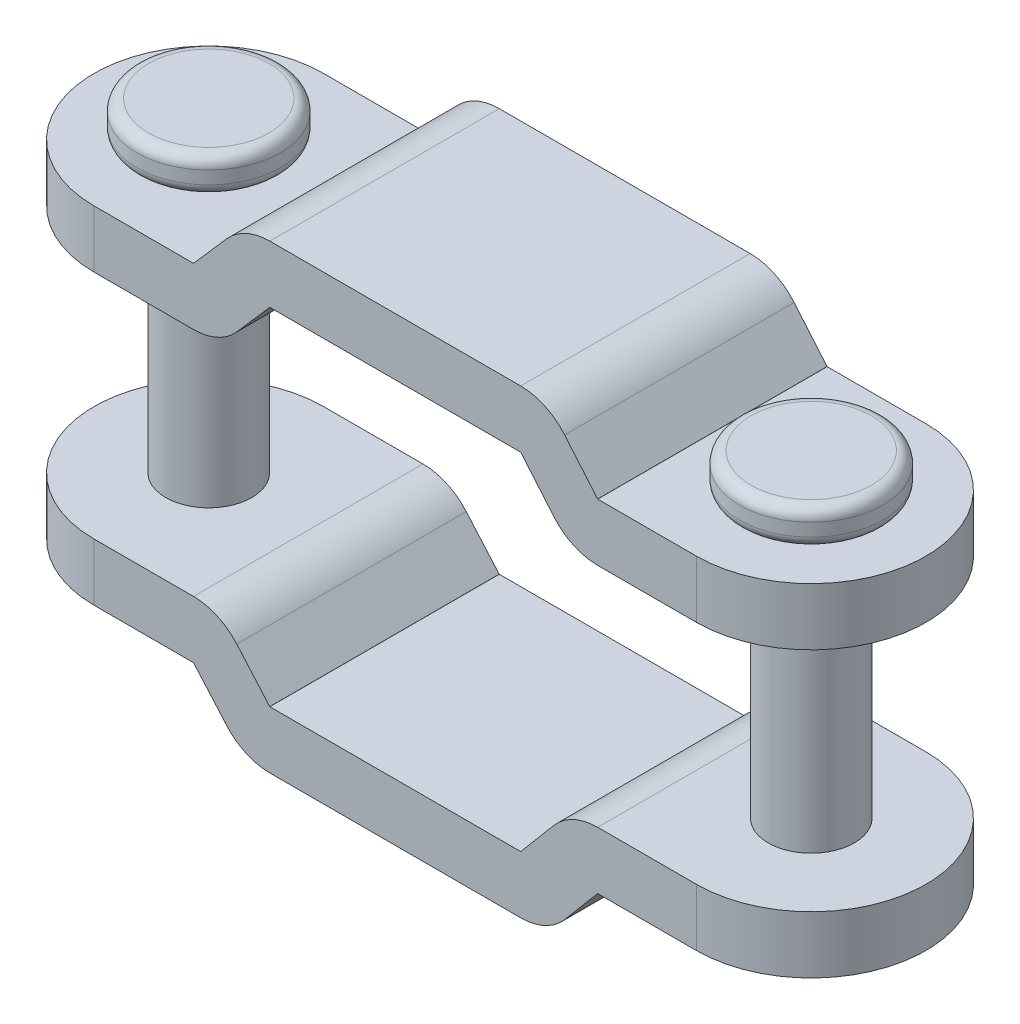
ISO-10303-21;
HEADER;
FILE_DESCRIPTION(('STEP AP214'),'2;1');
FILE_NAME('part.step','',(''),(''),'','','');
FILE_SCHEMA(('AUTOMOTIVE_DESIGN { 1 0 10303 214 1 1 1 1 }'));
ENDSEC;
DATA;
#1=APPLICATION_CONTEXT('core data for automotive mechanical design processes');
#2=APPLICATION_PROTOCOL_DEFINITION('international standard','automotive_design',2000,#1);
#3=PRODUCT_CONTEXT('',#1,'mechanical');
#4=PRODUCT('Part','Part','',(#3));
#5=PRODUCT_RELATED_PRODUCT_CATEGORY('part','',(#4));
#6=PRODUCT_DEFINITION_FORMATION('','',#4);
#7=PRODUCT_DEFINITION_CONTEXT('part definition',#1,'design');
#8=PRODUCT_DEFINITION('design','',#6,#7);
#9=PRODUCT_DEFINITION_SHAPE('','',#8);
#10=(LENGTH_UNIT() NAMED_UNIT(*) SI_UNIT(.MILLI.,.METRE.));
#11=(NAMED_UNIT(*) PLANE_ANGLE_UNIT() SI_UNIT($,.RADIAN.));
#12=(NAMED_UNIT(*) SI_UNIT($,.STERADIAN.) SOLID_ANGLE_UNIT());
#13=UNCERTAINTY_MEASURE_WITH_UNIT(LENGTH_MEASURE(1.E-05),#10,'distance_accuracy_value','');
#14=(GEOMETRIC_REPRESENTATION_CONTEXT(3) GLOBAL_UNCERTAINTY_ASSIGNED_CONTEXT((#13)) GLOBAL_UNIT_ASSIGNED_CONTEXT((#10,
#11,#12)) REPRESENTATION_CONTEXT('',''));
#15=CARTESIAN_POINT('',(0.,0.,0.));
#16=DIRECTION('',(0.,0.,1.));
#17=DIRECTION('',(1.,0.,0.));
#18=AXIS2_PLACEMENT_3D('',#15,#16,#17);
#19=CARTESIAN_POINT('',(42.0099999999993,14.2920589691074,0.));
#20=DIRECTION('',(0.,1.,0.));
#21=DIRECTION('',(-1.,0.,0.));
#22=AXIS2_PLACEMENT_3D('',#19,#20,#21);
#23=PLANE('',#22);
#24=CARTESIAN_POINT('',(42.0099999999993,14.2920589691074,0.));
#25=DIRECTION('',(0.,-1.,0.));
#26=DIRECTION('',(0.,0.,1.));
#27=AXIS2_PLACEMENT_3D('',#24,#25,#26);
#28=CIRCLE('',#27,4.20000000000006);
#29=CARTESIAN_POINT('',(42.0099999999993,14.2920589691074,4.2));
#30=VERTEX_POINT('',#29);
#31=CARTESIAN_POINT('',(42.0099999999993,14.2920589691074,-4.20000000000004));
#32=VERTEX_POINT('',#31);
#33=EDGE_CURVE('E501',#30,#32,#28,.T.);
#34=ORIENTED_EDGE('',*,*,#33,.F.);
#35=CARTESIAN_POINT('',(42.0099999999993,14.2920589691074,0.));
#36=DIRECTION('',(0.,-1.,0.));
#37=DIRECTION('',(0.,0.,-1.));
#38=AXIS2_PLACEMENT_3D('',#35,#36,#37);
#39=CIRCLE('',#38,4.20000000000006);
#40=EDGE_CURVE('E513',#32,#30,#39,.T.);
#41=ORIENTED_EDGE('',*,*,#40,.F.);
#42=EDGE_LOOP('',(#34,#41));
#43=FACE_BOUND('',#42,.T.);
#44=ADVANCED_FACE('F17',(#43),#23,.T.);
#45=CARTESIAN_POINT('',(0.,14.5579410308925,0.));
#46=DIRECTION('',(0.,1.,0.));
#47=DIRECTION('',(-1.,0.,0.));
#48=AXIS2_PLACEMENT_3D('',#45,#46,#47);
#49=PLANE('',#48);
#50=CARTESIAN_POINT('',(0.,14.5579410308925,0.));
#51=DIRECTION('',(0.,-1.,0.));
#52=DIRECTION('',(-1.,0.,0.));
#53=AXIS2_PLACEMENT_3D('',#50,#51,#52);
#54=CIRCLE('',#53,4.2);
#55=CARTESIAN_POINT('',(-4.2,14.5579410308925,0.));
#56=VERTEX_POINT('',#55);
#57=CARTESIAN_POINT('',(4.2,14.5579410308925,0.));
#58=VERTEX_POINT('',#57);
#59=EDGE_CURVE('E464',#56,#58,#54,.T.);
#60=ORIENTED_EDGE('',*,*,#59,.F.);
#61=CARTESIAN_POINT('',(0.,14.5579410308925,0.));
#62=DIRECTION('',(0.,-1.,0.));
#63=DIRECTION('',(1.,0.,0.));
#64=AXIS2_PLACEMENT_3D('',#61,#62,#63);
#65=CIRCLE('',#64,4.2);
#66=EDGE_CURVE('E458',#58,#56,#65,.T.);
#67=ORIENTED_EDGE('',*,*,#66,.F.);
#68=EDGE_LOOP('',(#60,#67));
#69=FACE_BOUND('',#68,.T.);
#70=ADVANCED_FACE('F469',(#69),#49,.T.);
#71=CARTESIAN_POINT('',(42.0099999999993,13.4920589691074,0.));
#72=DIRECTION('',(0.,1.,0.));
#73=DIRECTION('',(0.,0.,1.));
#74=AXIS2_PLACEMENT_3D('',#71,#72,#73);
#75=TOROIDAL_SURFACE('',#74,4.2,0.8);
#76=ORIENTED_EDGE('',*,*,#33,.T.);
#77=ORIENTED_EDGE('',*,*,#40,.T.);
#78=EDGE_LOOP('',(#76,#77));
#79=FACE_BOUND('',#78,.T.);
#80=CARTESIAN_POINT('',(42.0099999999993,13.4920589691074,0.));
#81=DIRECTION('',(0.,-1.,0.));
#82=DIRECTION('',(1.,0.,0.));
#83=AXIS2_PLACEMENT_3D('',#80,#81,#82);
#84=CIRCLE('',#83,5.);
#85=CARTESIAN_POINT('',(47.0099999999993,13.4920589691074,0.));
#86=VERTEX_POINT('',#85);
#87=EDGE_CURVE('E455',#86,#86,#84,.T.);
#88=ORIENTED_EDGE('',*,*,#87,.F.);
#89=EDGE_LOOP('',(#88));
#90=FACE_BOUND('',#89,.T.);
#91=ADVANCED_FACE('F444',(#79,#90),#75,.T.);
#92=CARTESIAN_POINT('',(0.,13.7579410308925,0.));
#93=DIRECTION('',(0.,1.,0.));
#94=DIRECTION('',(-1.,0.,0.));
#95=AXIS2_PLACEMENT_3D('',#92,#93,#94);
#96=TOROIDAL_SURFACE('',#95,4.19999999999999,0.8);
#97=ORIENTED_EDGE('',*,*,#59,.T.);
#98=ORIENTED_EDGE('',*,*,#66,.T.);
#99=EDGE_LOOP('',(#97,#98));
#100=FACE_BOUND('',#99,.T.);
#101=CARTESIAN_POINT('',(0.,13.7579410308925,0.));
#102=DIRECTION('',(0.,-1.,0.));
#103=DIRECTION('',(1.,0.,0.));
#104=AXIS2_PLACEMENT_3D('',#101,#102,#103);
#105=CIRCLE('',#104,5.);
#106=CARTESIAN_POINT('',(5.00000000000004,13.7579410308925,0.));
#107=VERTEX_POINT('',#106);
#108=EDGE_CURVE('E452',#107,#107,#105,.T.);
#109=ORIENTED_EDGE('',*,*,#108,.F.);
#110=EDGE_LOOP('',(#109));
#111=FACE_BOUND('',#110,.T.);
#112=ADVANCED_FACE('F439',(#100,#111),#96,.T.);
#113=CARTESIAN_POINT('',(42.0099999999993,14.2920589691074,0.));
#114=DIRECTION('',(0.,-1.,0.));
#115=DIRECTION('',(1.,0.,0.));
#116=AXIS2_PLACEMENT_3D('',#113,#114,#115);
#117=CYLINDRICAL_SURFACE('',#116,5.);
#118=CARTESIAN_POINT('',(42.0099999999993,12.5920589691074,0.));
#119=DIRECTION('',(0.,1.,0.));
#120=DIRECTION('',(0.,0.,1.));
#121=AXIS2_PLACEMENT_3D('',#118,#119,#120);
#122=CIRCLE('',#121,5.);
#123=CARTESIAN_POINT('',(42.0099999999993,12.5920589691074,5.));
#124=VERTEX_POINT('',#123);
#125=EDGE_CURVE('E294',#124,#124,#122,.F.);
#126=ORIENTED_EDGE('',*,*,#125,.F.);
#127=EDGE_LOOP('',(#126));
#128=FACE_BOUND('',#127,.T.);
#129=ORIENTED_EDGE('',*,*,#87,.T.);
#130=EDGE_LOOP('',(#129));
#131=FACE_BOUND('',#130,.T.);
#132=ADVANCED_FACE('F435',(#128,#131),#117,.T.);
#133=CARTESIAN_POINT('',(0.,14.5579410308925,0.));
#134=DIRECTION('',(0.,-1.,0.));
#135=DIRECTION('',(1.,0.,0.));
#136=AXIS2_PLACEMENT_3D('',#133,#134,#135);
#137=CYLINDRICAL_SURFACE('',#136,5.);
#138=CARTESIAN_POINT('',(0.,12.8579410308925,0.));
#139=DIRECTION('',(0.,1.,0.));
#140=DIRECTION('',(-1.,0.,0.));
#141=AXIS2_PLACEMENT_3D('',#138,#139,#140);
#142=CIRCLE('',#141,5.);
#143=CARTESIAN_POINT('',(-4.99999999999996,12.8579410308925,0.));
#144=VERTEX_POINT('',#143);
#145=EDGE_CURVE('E425',#144,#144,#142,.F.);
#146=ORIENTED_EDGE('',*,*,#145,.F.);
#147=EDGE_LOOP('',(#146));
#148=FACE_BOUND('',#147,.T.);
#149=ORIENTED_EDGE('',*,*,#108,.T.);
#150=EDGE_LOOP('',(#149));
#151=FACE_BOUND('',#150,.T.);
#152=ADVANCED_FACE('F431',(#148,#151),#137,.T.);
#153=CARTESIAN_POINT('',(42.0099999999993,12.5920589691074,0.));
#154=DIRECTION('',(0.,1.,0.));
#155=DIRECTION('',(0.,0.,1.));
#156=AXIS2_PLACEMENT_3D('',#153,#154,#155);
#157=TOROIDAL_SURFACE('',#156,4.2,0.8);
#158=ORIENTED_EDGE('',*,*,#125,.T.);
#159=EDGE_LOOP('',(#158));
#160=FACE_BOUND('',#159,.T.);
#161=CARTESIAN_POINT('',(42.0099999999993,11.9079410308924,0.));
#162=DIRECTION('',(0.,1.,0.));
#163=DIRECTION('',(0.,0.,1.));
#164=AXIS2_PLACEMENT_3D('',#161,#162,#163);
#165=CIRCLE('',#164,4.61470790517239);
#166=CARTESIAN_POINT('',(42.0099999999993,11.9079410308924,4.61470790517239));
#167=VERTEX_POINT('',#166);
#168=EDGE_CURVE('E646',#167,#167,#165,.T.);
#169=ORIENTED_EDGE('',*,*,#168,.T.);
#170=EDGE_LOOP('',(#169));
#171=FACE_BOUND('',#170,.T.);
#172=ADVANCED_FACE('F428',(#160,#171),#157,.T.);
#173=CARTESIAN_POINT('',(35.1187881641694,11.9179410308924,-7.99999999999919));
#174=DIRECTION('',(0.,0.,1.));
#175=DIRECTION('',(0.,-1.,0.));
#176=AXIS2_PLACEMENT_3D('',#173,#174,#175);
#177=CYLINDRICAL_SURFACE('',#176,0.00999999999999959);
#178=DIRECTION('',(0.,0.,1.));
#179=VECTOR('',#178,1.);
#180=CARTESIAN_POINT('',(35.1111438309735,11.9114940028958,-7.9999999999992));
#181=LINE('',#180,#179);
#182=CARTESIAN_POINT('',(35.1111438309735,11.9114940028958,-7.9999999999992));
#183=VERTEX_POINT('',#182);
#184=CARTESIAN_POINT('',(35.1111438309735,11.9114940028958,8.00000000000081));
#185=VERTEX_POINT('',#184);
#186=EDGE_CURVE('E297',#183,#185,#181,.T.);
#187=ORIENTED_EDGE('',*,*,#186,.T.);
#188=CARTESIAN_POINT('',(35.1187881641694,11.9179410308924,8.00000000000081));
#189=DIRECTION('',(0.,0.,1.));
#190=DIRECTION('',(0.,-1.,0.));
#191=AXIS2_PLACEMENT_3D('',#188,#189,#190);
#192=CIRCLE('',#191,0.00999999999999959);
#193=CARTESIAN_POINT('',(35.1187881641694,11.9079410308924,8.00000000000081));
#194=VERTEX_POINT('',#193);
#195=EDGE_CURVE('E280',#194,#185,#192,.F.);
#196=ORIENTED_EDGE('',*,*,#195,.F.);
#197=DIRECTION('',(0.,0.,1.));
#198=VECTOR('',#197,1.);
#199=CARTESIAN_POINT('',(35.1187881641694,11.9079410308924,-7.9999999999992));
#200=LINE('',#199,#198);
#201=CARTESIAN_POINT('',(35.1187881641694,11.9079410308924,-7.9999999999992));
#202=VERTEX_POINT('',#201);
#203=EDGE_CURVE('E649',#194,#202,#200,.F.);
#204=ORIENTED_EDGE('',*,*,#203,.T.);
#205=CARTESIAN_POINT('',(35.1187881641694,11.9179410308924,-7.9999999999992));
#206=DIRECTION('',(0.,0.,1.));
#207=DIRECTION('',(0.,-1.,0.));
#208=AXIS2_PLACEMENT_3D('',#205,#206,#207);
#209=CIRCLE('',#208,0.00999999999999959);
#210=EDGE_CURVE('E293',#183,#202,#209,.T.);
#211=ORIENTED_EDGE('',*,*,#210,.F.);
#212=EDGE_LOOP('',(#187,#196,#204,#211));
#213=FACE_BOUND('',#212,.T.);
#214=ADVANCED_FACE('F298',(#213),#177,.F.);
#215=CARTESIAN_POINT('',(29.7503521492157,12.0479410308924,-7.9999999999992));
#216=DIRECTION('',(0.,0.,1.));
#217=DIRECTION('',(0.,-1.,0.));
#218=AXIS2_PLACEMENT_3D('',#215,#216,#217);
#219=CYLINDRICAL_SURFACE('',#218,0.00999999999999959);
#220=DIRECTION('',(0.,0.,1.));
#221=VECTOR('',#220,1.);
#222=CARTESIAN_POINT('',(29.7579964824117,12.054388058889,-7.9999999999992));
#223=LINE('',#222,#221);
#224=CARTESIAN_POINT('',(29.7579964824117,12.054388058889,8.00000000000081));
#225=VERTEX_POINT('',#224);
#226=CARTESIAN_POINT('',(29.7579964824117,12.054388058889,-7.9999999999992));
#227=VERTEX_POINT('',#226);
#228=EDGE_CURVE('E805',#225,#227,#223,.F.);
#229=ORIENTED_EDGE('',*,*,#228,.F.);
#230=CARTESIAN_POINT('',(29.7503521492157,12.0479410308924,8.0000000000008));
#231=DIRECTION('',(0.,0.,1.));
#232=DIRECTION('',(0.,-1.,0.));
#233=AXIS2_PLACEMENT_3D('',#230,#231,#232);
#234=CIRCLE('',#233,0.00999999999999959);
#235=CARTESIAN_POINT('',(29.7503521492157,12.0579410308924,8.00000000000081));
#236=VERTEX_POINT('',#235);
#237=EDGE_CURVE('E660',#236,#225,#234,.F.);
#238=ORIENTED_EDGE('',*,*,#237,.F.);
#239=DIRECTION('',(0.,0.,1.));
#240=VECTOR('',#239,1.);
#241=CARTESIAN_POINT('',(29.7503521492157,12.0579410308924,-7.9999999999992));
#242=LINE('',#241,#240);
#243=CARTESIAN_POINT('',(29.7503521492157,12.0579410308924,-7.9999999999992));
#244=VERTEX_POINT('',#243);
#245=EDGE_CURVE('E799',#244,#236,#242,.T.);
#246=ORIENTED_EDGE('',*,*,#245,.F.);
#247=CARTESIAN_POINT('',(29.7503521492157,12.0479410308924,-7.99999999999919));
#248=DIRECTION('',(0.,0.,1.));
#249=DIRECTION('',(0.,-1.,0.));
#250=AXIS2_PLACEMENT_3D('',#247,#248,#249);
#251=CIRCLE('',#250,0.00999999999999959);
#252=EDGE_CURVE('E658',#227,#244,#251,.T.);
#253=ORIENTED_EDGE('',*,*,#252,.F.);
#254=EDGE_LOOP('',(#229,#238,#246,#253));
#255=FACE_BOUND('',#254,.T.);
#256=ADVANCED_FACE('F404',(#255),#219,.F.);
#257=CARTESIAN_POINT('',(0.,12.8579410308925,0.));
#258=DIRECTION('',(0.,1.,0.));
#259=DIRECTION('',(-1.,0.,0.));
#260=AXIS2_PLACEMENT_3D('',#257,#258,#259);
#261=TOROIDAL_SURFACE('',#260,4.20000000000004,0.8);
#262=ORIENTED_EDGE('',*,*,#145,.T.);
#263=EDGE_LOOP('',(#262));
#264=FACE_BOUND('',#263,.T.);
#265=CARTESIAN_POINT('',(0.,12.0579410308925,0.));
#266=DIRECTION('',(0.,1.,0.));
#267=DIRECTION('',(-1.,0.,0.));
#268=AXIS2_PLACEMENT_3D('',#265,#266,#267);
#269=CIRCLE('',#268,4.20000000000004);
#270=CARTESIAN_POINT('',(-4.2,12.0579410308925,0.));
#271=VERTEX_POINT('',#270);
#272=CARTESIAN_POINT('',(4.20000000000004,12.0579410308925,0.));
#273=VERTEX_POINT('',#272);
#274=EDGE_CURVE('E414',#271,#273,#269,.T.);
#275=ORIENTED_EDGE('',*,*,#274,.T.);
#276=CARTESIAN_POINT('',(0.,12.0579410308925,0.));
#277=DIRECTION('',(0.,1.,0.));
#278=DIRECTION('',(1.,0.,0.));
#279=AXIS2_PLACEMENT_3D('',#276,#277,#278);
#280=CIRCLE('',#279,4.20000000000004);
#281=EDGE_CURVE('E386',#273,#271,#280,.T.);
#282=ORIENTED_EDGE('',*,*,#281,.T.);
#283=EDGE_LOOP('',(#275,#282));
#284=FACE_BOUND('',#283,.T.);
#285=ADVANCED_FACE('F393',(#264,#284),#261,.T.);
#286=CARTESIAN_POINT('',(6.93538941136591,12.0679410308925,-7.9999999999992));
#287=DIRECTION('',(0.,0.,1.));
#288=DIRECTION('',(0.,-1.,0.));
#289=AXIS2_PLACEMENT_3D('',#286,#287,#288);
#290=CYLINDRICAL_SURFACE('',#289,0.00999999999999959);
#291=DIRECTION('',(0.,0.,1.));
#292=VECTOR('',#291,1.);
#293=CARTESIAN_POINT('',(6.93538941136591,12.0579410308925,-7.9999999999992));
#294=LINE('',#293,#292);
#295=CARTESIAN_POINT('',(6.93538941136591,12.0579410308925,-7.9999999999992));
#296=VERTEX_POINT('',#295);
#297=CARTESIAN_POINT('',(6.93538941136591,12.0579410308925,8.00000000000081));
#298=VERTEX_POINT('',#297);
#299=EDGE_CURVE('E762',#296,#298,#294,.T.);
#300=ORIENTED_EDGE('',*,*,#299,.T.);
#301=CARTESIAN_POINT('',(6.93538941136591,12.0679410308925,8.00000000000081));
#302=DIRECTION('',(0.,0.,1.));
#303=DIRECTION('',(0.,-1.,0.));
#304=AXIS2_PLACEMENT_3D('',#301,#302,#303);
#305=CIRCLE('',#304,0.00999999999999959);
#306=CARTESIAN_POINT('',(6.94291517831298,12.0613559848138,8.00000000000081));
#307=VERTEX_POINT('',#306);
#308=EDGE_CURVE('E656',#307,#298,#305,.F.);
#309=ORIENTED_EDGE('',*,*,#308,.F.);
#310=DIRECTION('',(0.,0.,1.));
#311=VECTOR('',#310,1.);
#312=CARTESIAN_POINT('',(6.94291517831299,12.0613559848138,-7.9999999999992));
#313=LINE('',#312,#311);
#314=CARTESIAN_POINT('',(6.94291517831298,12.0613559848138,-7.9999999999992));
#315=VERTEX_POINT('',#314);
#316=EDGE_CURVE('E757',#307,#315,#313,.F.);
#317=ORIENTED_EDGE('',*,*,#316,.T.);
#318=CARTESIAN_POINT('',(6.93538941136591,12.0679410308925,-7.9999999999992));
#319=DIRECTION('',(0.,0.,1.));
#320=DIRECTION('',(0.,-1.,0.));
#321=AXIS2_PLACEMENT_3D('',#318,#319,#320);
#322=CIRCLE('',#321,0.00999999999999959);
#323=EDGE_CURVE('E654',#296,#315,#322,.T.);
#324=ORIENTED_EDGE('',*,*,#323,.F.);
#325=EDGE_LOOP('',(#300,#309,#317,#324));
#326=FACE_BOUND('',#325,.T.);
#327=ADVANCED_FACE('F403',(#326),#290,.F.);
#328=CARTESIAN_POINT('',(12.259537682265,12.0479410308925,-7.9999999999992));
#329=DIRECTION('',(0.,0.,1.));
#330=DIRECTION('',(0.,-1.,0.));
#331=AXIS2_PLACEMENT_3D('',#328,#329,#330);
#332=CYLINDRICAL_SURFACE('',#331,0.00999999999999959);
#333=DIRECTION('',(0.,0.,1.));
#334=VECTOR('',#333,1.);
#335=CARTESIAN_POINT('',(12.259537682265,12.0579410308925,-7.9999999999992));
#336=LINE('',#335,#334);
#337=CARTESIAN_POINT('',(12.259537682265,12.0579410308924,8.00000000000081));
#338=VERTEX_POINT('',#337);
#339=CARTESIAN_POINT('',(12.259537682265,12.0579410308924,-7.9999999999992));
#340=VERTEX_POINT('',#339);
#341=EDGE_CURVE('E802',#338,#340,#336,.F.);
#342=ORIENTED_EDGE('',*,*,#341,.F.);
#343=CARTESIAN_POINT('',(12.259537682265,12.0479410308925,8.00000000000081));
#344=DIRECTION('',(0.,0.,1.));
#345=DIRECTION('',(0.,-1.,0.));
#346=AXIS2_PLACEMENT_3D('',#343,#344,#345);
#347=CIRCLE('',#346,0.00999999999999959);
#348=CARTESIAN_POINT('',(12.252011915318,12.0545260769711,8.00000000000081));
#349=VERTEX_POINT('',#348);
#350=EDGE_CURVE('E652',#349,#338,#347,.F.);
#351=ORIENTED_EDGE('',*,*,#350,.F.);
#352=DIRECTION('',(0.,0.,1.));
#353=VECTOR('',#352,1.);
#354=CARTESIAN_POINT('',(12.252011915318,12.0545260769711,-7.99999999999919));
#355=LINE('',#354,#353);
#356=CARTESIAN_POINT('',(12.252011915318,12.0545260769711,-7.9999999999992));
#357=VERTEX_POINT('',#356);
#358=EDGE_CURVE('E759',#357,#349,#355,.T.);
#359=ORIENTED_EDGE('',*,*,#358,.F.);
#360=CARTESIAN_POINT('',(12.259537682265,12.0479410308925,-7.9999999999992));
#361=DIRECTION('',(0.,0.,1.));
#362=DIRECTION('',(0.,-1.,0.));
#363=AXIS2_PLACEMENT_3D('',#360,#361,#362);
#364=CIRCLE('',#363,0.00999999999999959);
#365=EDGE_CURVE('E650',#340,#357,#364,.T.);
#366=ORIENTED_EDGE('',*,*,#365,.F.);
#367=EDGE_LOOP('',(#342,#351,#359,#366));
#368=FACE_BOUND('',#367,.T.);
#369=ADVANCED_FACE('F833',(#368),#332,.F.);
#370=CARTESIAN_POINT('',(42.0099999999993,-14.4079410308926,0.));
#371=DIRECTION('',(0.,1.,0.));
#372=DIRECTION('',(-1.,0.,0.));
#373=AXIS2_PLACEMENT_3D('',#370,#371,#372);
#374=PLANE('',#373);
#375=CARTESIAN_POINT('',(42.0099999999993,-14.4079410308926,0.));
#376=DIRECTION('',(0.,1.,0.));
#377=DIRECTION('',(1.,0.,0.));
#378=AXIS2_PLACEMENT_3D('',#375,#376,#377);
#379=CIRCLE('',#378,4.20000000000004);
#380=CARTESIAN_POINT('',(46.2099999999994,-14.4079410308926,0.));
#381=VERTEX_POINT('',#380);
#382=CARTESIAN_POINT('',(37.8099999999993,-14.4079410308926,0.));
#383=VERTEX_POINT('',#382);
#384=EDGE_CURVE('E645',#381,#383,#379,.T.);
#385=ORIENTED_EDGE('',*,*,#384,.F.);
#386=CARTESIAN_POINT('',(42.0099999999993,-14.4079410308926,0.));
#387=DIRECTION('',(0.,1.,0.));
#388=DIRECTION('',(-1.,0.,0.));
#389=AXIS2_PLACEMENT_3D('',#386,#387,#388);
#390=CIRCLE('',#389,4.20000000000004);
#391=EDGE_CURVE('E798',#383,#381,#390,.T.);
#392=ORIENTED_EDGE('',*,*,#391,.F.);
#393=EDGE_LOOP('',(#385,#392));
#394=FACE_BOUND('',#393,.T.);
#395=ADVANCED_FACE('F823',(#394),#374,.F.);
#396=CARTESIAN_POINT('',(12.2549999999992,16.0579410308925,-7.9999999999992));
#397=DIRECTION('',(0.,-1.,0.));
#398=DIRECTION('',(1.,0.,0.));
#399=AXIS2_PLACEMENT_3D('',#396,#397,#398);
#400=PLANE('',#399);
#401=DIRECTION('',(0.,0.,1.));
#402=VECTOR('',#401,1.);
#403=CARTESIAN_POINT('',(12.259537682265,16.0579410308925,-7.9999999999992));
#404=LINE('',#403,#402);
#405=CARTESIAN_POINT('',(12.259537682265,16.0579410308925,8.0000000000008));
#406=VERTEX_POINT('',#405);
#407=CARTESIAN_POINT('',(12.259537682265,16.0579410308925,-7.9999999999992));
#408=VERTEX_POINT('',#407);
#409=EDGE_CURVE('E754',#406,#408,#404,.F.);
#410=ORIENTED_EDGE('',*,*,#409,.F.);
#411=DIRECTION('',(1.,0.,0.));
#412=VECTOR('',#411,1.);
#413=CARTESIAN_POINT('',(35.1187881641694,16.0579410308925,8.00000000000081));
#414=LINE('',#413,#412);
#415=CARTESIAN_POINT('',(29.7503521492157,16.0579410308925,8.0000000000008));
#416=VERTEX_POINT('',#415);
#417=EDGE_CURVE('E311',#406,#416,#414,.T.);
#418=ORIENTED_EDGE('',*,*,#417,.T.);
#419=DIRECTION('',(0.,0.,1.));
#420=VECTOR('',#419,1.);
#421=CARTESIAN_POINT('',(29.7503521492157,16.0579410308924,-7.9999999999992));
#422=LINE('',#421,#420);
#423=CARTESIAN_POINT('',(29.7503521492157,16.0579410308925,-7.99999999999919));
#424=VERTEX_POINT('',#423);
#425=EDGE_CURVE('E303',#424,#416,#422,.T.);
#426=ORIENTED_EDGE('',*,*,#425,.F.);
#427=DIRECTION('',(1.,0.,0.));
#428=VECTOR('',#427,1.);
#429=CARTESIAN_POINT('',(35.1111438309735,16.0579410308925,-7.9999999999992));
#430=LINE('',#429,#428);
#431=EDGE_CURVE('E636',#408,#424,#430,.T.);
#432=ORIENTED_EDGE('',*,*,#431,.F.);
#433=EDGE_LOOP('',(#410,#418,#426,#432));
#434=FACE_BOUND('',#433,.T.);
#435=ADVANCED_FACE('F832',(#434),#400,.F.);
#436=CARTESIAN_POINT('',(29.7503521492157,12.0479410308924,-7.9999999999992));
#437=DIRECTION('',(0.,0.,1.));
#438=DIRECTION('',(0.,-1.,0.));
#439=AXIS2_PLACEMENT_3D('',#436,#437,#438);
#440=CYLINDRICAL_SURFACE('',#439,4.01);
#441=CARTESIAN_POINT('',(29.7503521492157,12.0479410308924,-7.99999999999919));
#442=DIRECTION('',(0.,0.,1.));
#443=DIRECTION('',(0.,-1.,0.));
#444=AXIS2_PLACEMENT_3D('',#441,#442,#443);
#445=CIRCLE('',#444,4.01);
#446=CARTESIAN_POINT('',(32.8157297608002,14.6331992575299,-7.9999999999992));
#447=VERTEX_POINT('',#446);
#448=EDGE_CURVE('E633',#424,#447,#445,.F.);
#449=ORIENTED_EDGE('',*,*,#448,.F.);
#450=ORIENTED_EDGE('',*,*,#425,.T.);
#451=CARTESIAN_POINT('',(29.7503521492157,12.0479410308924,8.0000000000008));
#452=DIRECTION('',(0.,0.,1.));
#453=DIRECTION('',(0.,-1.,0.));
#454=AXIS2_PLACEMENT_3D('',#451,#452,#453);
#455=CIRCLE('',#454,4.01);
#456=CARTESIAN_POINT('',(32.8157297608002,14.6331992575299,8.00000000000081));
#457=VERTEX_POINT('',#456);
#458=EDGE_CURVE('E307',#416,#457,#455,.F.);
#459=ORIENTED_EDGE('',*,*,#458,.T.);
#460=DIRECTION('',(0.,0.,1.));
#461=VECTOR('',#460,1.);
#462=CARTESIAN_POINT('',(32.8157297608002,14.6331992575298,-7.9999999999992));
#463=LINE('',#462,#461);
#464=EDGE_CURVE('E302',#457,#447,#463,.F.);
#465=ORIENTED_EDGE('',*,*,#464,.T.);
#466=EDGE_LOOP('',(#449,#450,#459,#465));
#467=FACE_BOUND('',#466,.T.);
#468=ADVANCED_FACE('F1523',(#467),#440,.T.);
#469=CARTESIAN_POINT('',(32.8127332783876,14.6367522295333,-7.9999999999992));
#470=DIRECTION('',(-0.764433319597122,-0.644702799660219,0.));
#471=DIRECTION('',(0.644702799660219,-0.764433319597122,0.));
#472=AXIS2_PLACEMENT_3D('',#469,#470,#471);
#473=PLANE('',#472);
#474=ORIENTED_EDGE('',*,*,#464,.F.);
#475=DIRECTION('',(0.644702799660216,-0.764433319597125,0.));
#476=VECTOR('',#475,1.);
#477=CARTESIAN_POINT('',(32.8157297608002,14.6331992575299,8.00000000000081));
#478=LINE('',#477,#476);
#479=EDGE_CURVE('E288',#457,#185,#478,.T.);
#480=ORIENTED_EDGE('',*,*,#479,.T.);
#481=ORIENTED_EDGE('',*,*,#186,.F.);
#482=DIRECTION('',(0.644702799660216,-0.764433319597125,0.));
#483=VECTOR('',#482,1.);
#484=CARTESIAN_POINT('',(32.8157297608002,14.6331992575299,-7.9999999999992));
#485=LINE('',#484,#483);
#486=EDGE_CURVE('E635',#447,#183,#485,.T.);
#487=ORIENTED_EDGE('',*,*,#486,.F.);
#488=EDGE_LOOP('',(#474,#480,#481,#487));
#489=FACE_BOUND('',#488,.T.);
#490=ADVANCED_FACE('F305',(#489),#473,.F.);
#491=CARTESIAN_POINT('',(33.2549999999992,11.9079410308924,-7.9999999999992));
#492=DIRECTION('',(0.,-1.,0.));
#493=DIRECTION('',(1.,0.,0.));
#494=AXIS2_PLACEMENT_3D('',#491,#492,#493);
#495=PLANE('',#494);
#496=ORIENTED_EDGE('',*,*,#203,.F.);
#497=DIRECTION('',(1.,0.,0.));
#498=VECTOR('',#497,1.);
#499=CARTESIAN_POINT('',(35.1187881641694,11.9079410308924,8.00000000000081));
#500=LINE('',#499,#498);
#501=CARTESIAN_POINT('',(42.0099999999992,11.9079410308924,8.00000000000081));
#502=VERTEX_POINT('',#501);
#503=EDGE_CURVE('E292',#194,#502,#500,.T.);
#504=ORIENTED_EDGE('',*,*,#503,.T.);
#505=CARTESIAN_POINT('',(42.0099999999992,11.9079410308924,8.04911692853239E-13));
#506=DIRECTION('',(0.,1.,0.));
#507=DIRECTION('',(-1.,0.,0.));
#508=AXIS2_PLACEMENT_3D('',#505,#506,#507);
#509=CIRCLE('',#508,8.);
#510=CARTESIAN_POINT('',(42.0099999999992,11.9079410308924,-7.9999999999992));
#511=VERTEX_POINT('',#510);
#512=EDGE_CURVE('E643',#511,#502,#509,.F.);
#513=ORIENTED_EDGE('',*,*,#512,.F.);
#514=DIRECTION('',(1.,0.,0.));
#515=VECTOR('',#514,1.);
#516=CARTESIAN_POINT('',(35.1111438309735,11.9079410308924,-7.9999999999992));
#517=LINE('',#516,#515);
#518=EDGE_CURVE('E345',#202,#511,#517,.T.);
#519=ORIENTED_EDGE('',*,*,#518,.F.);
#520=EDGE_LOOP('',(#496,#504,#513,#519));
#521=FACE_BOUND('',#520,.T.);
#522=ORIENTED_EDGE('',*,*,#168,.F.);
#523=EDGE_LOOP('',(#522));
#524=FACE_BOUND('',#523,.T.);
#525=ADVANCED_FACE('F1506',(#521,#524),#495,.F.);
#526=CARTESIAN_POINT('',(29.7549999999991,12.0579410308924,-7.9999999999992));
#527=DIRECTION('',(-0.764433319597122,-0.644702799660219,0.));
#528=DIRECTION('',(0.644702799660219,-0.764433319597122,0.));
#529=AXIS2_PLACEMENT_3D('',#526,#527,#528);
#530=PLANE('',#529);
#531=DIRECTION('',(-0.64470279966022,0.764433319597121,0.));
#532=VECTOR('',#531,1.);
#533=CARTESIAN_POINT('',(32.053410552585,9.33268280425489,-7.9999999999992));
#534=LINE('',#533,#532);
#535=CARTESIAN_POINT('',(32.053410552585,9.33268280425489,-7.9999999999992));
#536=VERTEX_POINT('',#535);
#537=EDGE_CURVE('E632',#536,#227,#534,.T.);
#538=ORIENTED_EDGE('',*,*,#537,.F.);
#539=DIRECTION('',(0.,0.,1.));
#540=VECTOR('',#539,1.);
#541=CARTESIAN_POINT('',(32.053410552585,9.33268280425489,-7.99999999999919));
#542=LINE('',#541,#540);
#543=CARTESIAN_POINT('',(32.053410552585,9.3326828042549,8.00000000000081));
#544=VERTEX_POINT('',#543);
#545=EDGE_CURVE('E336',#544,#536,#542,.F.);
#546=ORIENTED_EDGE('',*,*,#545,.F.);
#547=DIRECTION('',(-0.64470279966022,0.764433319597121,0.));
#548=VECTOR('',#547,1.);
#549=CARTESIAN_POINT('',(32.053410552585,9.33268280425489,8.00000000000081));
#550=LINE('',#549,#548);
#551=EDGE_CURVE('E329',#544,#225,#550,.T.);
#552=ORIENTED_EDGE('',*,*,#551,.T.);
#553=ORIENTED_EDGE('',*,*,#228,.T.);
#554=EDGE_LOOP('',(#538,#546,#552,#553));
#555=FACE_BOUND('',#554,.T.);
#556=ADVANCED_FACE('F1151',(#555),#530,.T.);
#557=CARTESIAN_POINT('',(12.2549999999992,12.0579410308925,-7.9999999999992));
#558=DIRECTION('',(0.,-1.,0.));
#559=DIRECTION('',(1.,0.,0.));
#560=AXIS2_PLACEMENT_3D('',#557,#558,#559);
#561=PLANE('',#560);
#562=DIRECTION('',(1.,0.,0.));
#563=VECTOR('',#562,1.);
#564=CARTESIAN_POINT('',(35.1111438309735,12.0579410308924,-7.9999999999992));
#565=LINE('',#564,#563);
#566=EDGE_CURVE('E1154',#244,#340,#565,.F.);
#567=ORIENTED_EDGE('',*,*,#566,.F.);
#568=ORIENTED_EDGE('',*,*,#245,.T.);
#569=DIRECTION('',(1.,0.,0.));
#570=VECTOR('',#569,1.);
#571=CARTESIAN_POINT('',(35.1187881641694,12.0579410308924,8.00000000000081));
#572=LINE('',#571,#570);
#573=EDGE_CURVE('E326',#236,#338,#572,.F.);
#574=ORIENTED_EDGE('',*,*,#573,.T.);
#575=ORIENTED_EDGE('',*,*,#341,.T.);
#576=EDGE_LOOP('',(#567,#568,#574,#575));
#577=FACE_BOUND('',#576,.T.);
#578=ADVANCED_FACE('F781',(#577),#561,.T.);
#579=CARTESIAN_POINT('',(-8.00000000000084,12.0579410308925,-7.9999999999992));
#580=DIRECTION('',(0.,-1.,0.));
#581=DIRECTION('',(1.,0.,0.));
#582=AXIS2_PLACEMENT_3D('',#579,#580,#581);
#583=PLANE('',#582);
#584=ORIENTED_EDGE('',*,*,#299,.F.);
#585=DIRECTION('',(1.,0.,0.));
#586=VECTOR('',#585,1.);
#587=CARTESIAN_POINT('',(35.1111438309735,12.0579410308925,-7.9999999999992));
#588=LINE('',#587,#586);
#589=CARTESIAN_POINT('',(-8.4998674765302E-13,12.0579410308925,-7.9999999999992));
#590=VERTEX_POINT('',#589);
#591=EDGE_CURVE('E1167',#590,#296,#588,.T.);
#592=ORIENTED_EDGE('',*,*,#591,.F.);
#593=CARTESIAN_POINT('',(-8.46545056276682E-13,12.0579410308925,8.04911692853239E-13));
#594=DIRECTION('',(0.,-1.,0.));
#595=DIRECTION('',(1.,0.,0.));
#596=AXIS2_PLACEMENT_3D('',#593,#594,#595);
#597=CIRCLE('',#596,8.);
#598=CARTESIAN_POINT('',(-8.47216060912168E-13,12.0579410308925,8.00000000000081));
#599=VERTEX_POINT('',#598);
#600=EDGE_CURVE('E637',#599,#590,#597,.T.);
#601=ORIENTED_EDGE('',*,*,#600,.F.);
#602=DIRECTION('',(1.,0.,0.));
#603=VECTOR('',#602,1.);
#604=CARTESIAN_POINT('',(35.1187881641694,12.0579410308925,8.00000000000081));
#605=LINE('',#604,#603);
#606=EDGE_CURVE('E321',#599,#298,#605,.T.);
#607=ORIENTED_EDGE('',*,*,#606,.T.);
#608=EDGE_LOOP('',(#584,#592,#601,#607));
#609=FACE_BOUND('',#608,.T.);
#610=ORIENTED_EDGE('',*,*,#281,.F.);
#611=ORIENTED_EDGE('',*,*,#274,.F.);
#612=EDGE_LOOP('',(#610,#611));
#613=FACE_BOUND('',#612,.T.);
#614=ADVANCED_FACE('F770',(#609,#613),#583,.F.);
#615=CARTESIAN_POINT('',(5.74469322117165,10.6919594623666,-7.9999999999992));
#616=DIRECTION('',(0.752576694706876,-0.658504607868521,0.));
#617=DIRECTION('',(0.658504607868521,0.752576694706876,0.));
#618=AXIS2_PLACEMENT_3D('',#615,#616,#617);
#619=PLANE('',#618);
#620=ORIENTED_EDGE('',*,*,#316,.F.);
#621=DIRECTION('',(0.658504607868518,0.752576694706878,0.));
#622=VECTOR('',#621,1.);
#623=CARTESIAN_POINT('',(6.94291517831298,12.0613559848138,8.00000000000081));
#624=LINE('',#623,#622);
#625=CARTESIAN_POINT('',(9.24170513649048,14.6885445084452,8.00000000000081));
#626=VERTEX_POINT('',#625);
#627=EDGE_CURVE('E318',#307,#626,#624,.T.);
#628=ORIENTED_EDGE('',*,*,#627,.T.);
#629=DIRECTION('',(0.,0.,1.));
#630=VECTOR('',#629,1.);
#631=CARTESIAN_POINT('',(9.24170513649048,14.6885445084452,-7.9999999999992));
#632=LINE('',#631,#630);
#633=CARTESIAN_POINT('',(9.24170513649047,14.6885445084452,-7.9999999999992));
#634=VERTEX_POINT('',#633);
#635=EDGE_CURVE('E756',#634,#626,#632,.T.);
#636=ORIENTED_EDGE('',*,*,#635,.F.);
#637=DIRECTION('',(0.658504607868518,0.752576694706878,0.));
#638=VECTOR('',#637,1.);
#639=CARTESIAN_POINT('',(6.94291517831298,12.0613559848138,-7.9999999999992));
#640=LINE('',#639,#638);
#641=EDGE_CURVE('E629',#315,#634,#640,.T.);
#642=ORIENTED_EDGE('',*,*,#641,.F.);
#643=EDGE_LOOP('',(#620,#628,#636,#642));
#644=FACE_BOUND('',#643,.T.);
#645=ADVANCED_FACE('F780',(#644),#619,.F.);
#646=CARTESIAN_POINT('',(12.259537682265,12.0479410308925,-7.9999999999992));
#647=DIRECTION('',(0.,0.,1.));
#648=DIRECTION('',(0.,-1.,0.));
#649=AXIS2_PLACEMENT_3D('',#646,#647,#648);
#650=CYLINDRICAL_SURFACE('',#649,4.01);
#651=CARTESIAN_POINT('',(12.259537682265,12.0479410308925,-7.9999999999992));
#652=DIRECTION('',(0.,0.,1.));
#653=DIRECTION('',(0.,-1.,0.));
#654=AXIS2_PLACEMENT_3D('',#651,#652,#653);
#655=CIRCLE('',#654,4.01);
#656=EDGE_CURVE('E626',#634,#408,#655,.F.);
#657=ORIENTED_EDGE('',*,*,#656,.F.);
#658=ORIENTED_EDGE('',*,*,#635,.T.);
#659=CARTESIAN_POINT('',(12.259537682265,12.0479410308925,8.0000000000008));
#660=DIRECTION('',(0.,0.,1.));
#661=DIRECTION('',(0.,-1.,0.));
#662=AXIS2_PLACEMENT_3D('',#659,#660,#661);
#663=CIRCLE('',#662,4.01);
#664=EDGE_CURVE('E317',#626,#406,#663,.F.);
#665=ORIENTED_EDGE('',*,*,#664,.T.);
#666=ORIENTED_EDGE('',*,*,#409,.T.);
#667=EDGE_LOOP('',(#657,#658,#665,#666));
#668=FACE_BOUND('',#667,.T.);
#669=ADVANCED_FACE('F1478',(#668),#650,.T.);
#670=CARTESIAN_POINT('',(8.75499999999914,8.05794103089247,-7.99999999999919));
#671=DIRECTION('',(0.752576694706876,-0.658504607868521,0.));
#672=DIRECTION('',(0.658504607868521,0.752576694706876,0.));
#673=AXIS2_PLACEMENT_3D('',#670,#671,#672);
#674=PLANE('',#673);
#675=DIRECTION('',(-0.658504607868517,-0.752576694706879,0.));
#676=VECTOR('',#675,1.);
#677=CARTESIAN_POINT('',(12.252011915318,12.0545260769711,-7.9999999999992));
#678=LINE('',#677,#676);
#679=CARTESIAN_POINT('',(9.9532219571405,9.42733755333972,-7.9999999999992));
#680=VERTEX_POINT('',#679);
#681=EDGE_CURVE('E1157',#357,#680,#678,.T.);
#682=ORIENTED_EDGE('',*,*,#681,.F.);
#683=ORIENTED_EDGE('',*,*,#358,.T.);
#684=DIRECTION('',(-0.658504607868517,-0.752576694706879,0.));
#685=VECTOR('',#684,1.);
#686=CARTESIAN_POINT('',(12.252011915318,12.0545260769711,8.00000000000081));
#687=LINE('',#686,#685);
#688=CARTESIAN_POINT('',(9.9532219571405,9.42733755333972,8.00000000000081));
#689=VERTEX_POINT('',#688);
#690=EDGE_CURVE('E324',#349,#689,#687,.T.);
#691=ORIENTED_EDGE('',*,*,#690,.T.);
#692=DIRECTION('',(0.,0.,1.));
#693=VECTOR('',#692,1.);
#694=CARTESIAN_POINT('',(9.95322195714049,9.42733755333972,-7.9999999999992));
#695=LINE('',#694,#693);
#696=EDGE_CURVE('E623',#680,#689,#695,.T.);
#697=ORIENTED_EDGE('',*,*,#696,.F.);
#698=EDGE_LOOP('',(#682,#683,#691,#697));
#699=FACE_BOUND('',#698,.T.);
#700=ADVANCED_FACE('F1190',(#699),#674,.T.);
#701=CARTESIAN_POINT('',(0.,-14.4420589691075,0.));
#702=DIRECTION('',(0.,1.,0.));
#703=DIRECTION('',(-1.,0.,0.));
#704=AXIS2_PLACEMENT_3D('',#701,#702,#703);
#705=PLANE('',#704);
#706=CARTESIAN_POINT('',(0.,-14.4420589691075,0.));
#707=DIRECTION('',(0.,1.,0.));
#708=DIRECTION('',(1.,0.,0.));
#709=AXIS2_PLACEMENT_3D('',#706,#707,#708);
#710=CIRCLE('',#709,4.20000000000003);
#711=CARTESIAN_POINT('',(4.2,-14.4420589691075,0.));
#712=VERTEX_POINT('',#711);
#713=CARTESIAN_POINT('',(-4.2,-14.4420589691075,0.));
#714=VERTEX_POINT('',#713);
#715=EDGE_CURVE('E1672',#712,#714,#710,.T.);
#716=ORIENTED_EDGE('',*,*,#715,.F.);
#717=CARTESIAN_POINT('',(0.,-14.4420589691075,0.));
#718=DIRECTION('',(0.,1.,0.));
#719=DIRECTION('',(-1.,0.,0.));
#720=AXIS2_PLACEMENT_3D('',#717,#718,#719);
#721=CIRCLE('',#720,4.20000000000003);
#722=EDGE_CURVE('E753',#714,#712,#721,.T.);
#723=ORIENTED_EDGE('',*,*,#722,.F.);
#724=EDGE_LOOP('',(#716,#723));
#725=FACE_BOUND('',#724,.T.);
#726=ADVANCED_FACE('F357',(#725),#705,.F.);
#727=CARTESIAN_POINT('',(42.0099999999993,-13.6079410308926,0.));
#728=DIRECTION('',(0.,1.,0.));
#729=DIRECTION('',(-1.,0.,0.));
#730=AXIS2_PLACEMENT_3D('',#727,#728,#729);
#731=TOROIDAL_SURFACE('',#730,4.2,0.8);
#732=ORIENTED_EDGE('',*,*,#391,.T.);
#733=ORIENTED_EDGE('',*,*,#384,.T.);
#734=EDGE_LOOP('',(#732,#733));
#735=FACE_BOUND('',#734,.T.);
#736=CARTESIAN_POINT('',(42.0099999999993,-13.6079410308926,0.));
#737=DIRECTION('',(0.,-1.,0.));
#738=DIRECTION('',(1.,0.,0.));
#739=AXIS2_PLACEMENT_3D('',#736,#737,#738);
#740=CIRCLE('',#739,5.);
#741=CARTESIAN_POINT('',(47.0099999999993,-13.6079410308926,0.));
#742=VERTEX_POINT('',#741);
#743=EDGE_CURVE('E348',#742,#742,#740,.F.);
#744=ORIENTED_EDGE('',*,*,#743,.F.);
#745=EDGE_LOOP('',(#744));
#746=FACE_BOUND('',#745,.T.);
#747=ADVANCED_FACE('F351',(#735,#746),#731,.T.);
#748=CARTESIAN_POINT('',(42.0099999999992,11.9079410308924,8.04911692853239E-13));
#749=DIRECTION('',(0.,1.,0.));
#750=DIRECTION('',(-1.,0.,0.));
#751=AXIS2_PLACEMENT_3D('',#748,#749,#750);
#752=CYLINDRICAL_SURFACE('',#751,8.);
#753=DIRECTION('',(0.,1.,0.));
#754=VECTOR('',#753,1.);
#755=CARTESIAN_POINT('',(42.0099999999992,11.9179410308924,8.00000000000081));
#756=LINE('',#755,#754);
#757=CARTESIAN_POINT('',(42.0099999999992,7.90794103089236,8.00000000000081));
#758=VERTEX_POINT('',#757);
#759=EDGE_CURVE('E333',#502,#758,#756,.F.);
#760=ORIENTED_EDGE('',*,*,#759,.T.);
#761=CARTESIAN_POINT('',(42.0099999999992,7.90794103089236,8.05191552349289E-13));
#762=DIRECTION('',(0.,1.,0.));
#763=DIRECTION('',(-1.,0.,0.));
#764=AXIS2_PLACEMENT_3D('',#761,#762,#763);
#765=CIRCLE('',#764,8.);
#766=CARTESIAN_POINT('',(42.0099999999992,7.90794103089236,-7.9999999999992));
#767=VERTEX_POINT('',#766);
#768=EDGE_CURVE('E617',#767,#758,#765,.F.);
#769=ORIENTED_EDGE('',*,*,#768,.F.);
#770=DIRECTION('',(0.,1.,0.));
#771=VECTOR('',#770,1.);
#772=CARTESIAN_POINT('',(42.0099999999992,11.9114940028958,-7.9999999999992));
#773=LINE('',#772,#771);
#774=EDGE_CURVE('E342',#511,#767,#773,.F.);
#775=ORIENTED_EDGE('',*,*,#774,.F.);
#776=ORIENTED_EDGE('',*,*,#512,.T.);
#777=EDGE_LOOP('',(#760,#769,#775,#776));
#778=FACE_BOUND('',#777,.T.);
#779=ADVANCED_FACE('F356',(#778),#752,.T.);
#780=CARTESIAN_POINT('',(35.1187881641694,11.9179410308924,-7.99999999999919));
#781=DIRECTION('',(0.,0.,1.));
#782=DIRECTION('',(0.,-1.,0.));
#783=AXIS2_PLACEMENT_3D('',#780,#781,#782);
#784=CYLINDRICAL_SURFACE('',#783,4.01);
#785=CARTESIAN_POINT('',(35.1187881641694,11.9179410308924,-7.9999999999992));
#786=DIRECTION('',(0.,0.,1.));
#787=DIRECTION('',(0.,-1.,0.));
#788=AXIS2_PLACEMENT_3D('',#785,#786,#787);
#789=CIRCLE('',#788,4.01);
#790=CARTESIAN_POINT('',(35.1187881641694,7.90794103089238,-7.9999999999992));
#791=VERTEX_POINT('',#790);
#792=EDGE_CURVE('E344',#791,#536,#789,.F.);
#793=ORIENTED_EDGE('',*,*,#792,.F.);
#794=DIRECTION('',(0.,0.,1.));
#795=VECTOR('',#794,1.);
#796=CARTESIAN_POINT('',(35.1187881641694,7.90794103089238,-7.9999999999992));
#797=LINE('',#796,#795);
#798=CARTESIAN_POINT('',(35.1187881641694,7.90794103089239,8.00000000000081));
#799=VERTEX_POINT('',#798);
#800=EDGE_CURVE('E337',#799,#791,#797,.F.);
#801=ORIENTED_EDGE('',*,*,#800,.F.);
#802=CARTESIAN_POINT('',(35.1187881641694,11.9179410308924,8.00000000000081));
#803=DIRECTION('',(0.,0.,1.));
#804=DIRECTION('',(0.,-1.,0.));
#805=AXIS2_PLACEMENT_3D('',#802,#803,#804);
#806=CIRCLE('',#805,4.01);
#807=EDGE_CURVE('E332',#799,#544,#806,.F.);
#808=ORIENTED_EDGE('',*,*,#807,.T.);
#809=ORIENTED_EDGE('',*,*,#545,.T.);
#810=EDGE_LOOP('',(#793,#801,#808,#809));
#811=FACE_BOUND('',#810,.T.);
#812=ADVANCED_FACE('F1145',(#811),#784,.T.);
#813=CARTESIAN_POINT('',(35.1187881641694,11.9179410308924,8.00000000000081));
#814=DIRECTION('',(0.,0.,-1.));
#815=DIRECTION('',(0.,1.,0.));
#816=AXIS2_PLACEMENT_3D('',#813,#814,#815);
#817=PLANE('',#816);
#818=ORIENTED_EDGE('',*,*,#195,.T.);
#819=ORIENTED_EDGE('',*,*,#479,.F.);
#820=ORIENTED_EDGE('',*,*,#458,.F.);
#821=ORIENTED_EDGE('',*,*,#417,.F.);
#822=ORIENTED_EDGE('',*,*,#664,.F.);
#823=ORIENTED_EDGE('',*,*,#627,.F.);
#824=ORIENTED_EDGE('',*,*,#308,.T.);
#825=ORIENTED_EDGE('',*,*,#606,.F.);
#826=DIRECTION('',(0.,-1.,0.));
#827=VECTOR('',#826,1.);
#828=CARTESIAN_POINT('',(-8.47831554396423E-13,12.0579410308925,8.00000000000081));
#829=LINE('',#828,#827);
#830=CARTESIAN_POINT('',(-8.60564974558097E-13,8.05794103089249,8.00000000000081));
#831=VERTEX_POINT('',#830);
#832=EDGE_CURVE('E309',#831,#599,#829,.F.);
#833=ORIENTED_EDGE('',*,*,#832,.F.);
#834=DIRECTION('',(1.,0.,0.));
#835=VECTOR('',#834,1.);
#836=CARTESIAN_POINT('',(-8.00000000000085,8.05794103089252,8.00000000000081));
#837=LINE('',#836,#835);
#838=CARTESIAN_POINT('',(6.9353894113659,8.05794103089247,8.00000000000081));
#839=VERTEX_POINT('',#838);
#840=EDGE_CURVE('E340',#839,#831,#837,.F.);
#841=ORIENTED_EDGE('',*,*,#840,.F.);
#842=CARTESIAN_POINT('',(6.93538941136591,12.0679410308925,8.00000000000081));
#843=DIRECTION('',(0.,0.,1.));
#844=DIRECTION('',(0.,-1.,0.));
#845=AXIS2_PLACEMENT_3D('',#842,#843,#844);
#846=CIRCLE('',#845,4.01);
#847=EDGE_CURVE('E624',#689,#839,#846,.F.);
#848=ORIENTED_EDGE('',*,*,#847,.F.);
#849=ORIENTED_EDGE('',*,*,#690,.F.);
#850=ORIENTED_EDGE('',*,*,#350,.T.);
#851=ORIENTED_EDGE('',*,*,#573,.F.);
#852=ORIENTED_EDGE('',*,*,#237,.T.);
#853=ORIENTED_EDGE('',*,*,#551,.F.);
#854=ORIENTED_EDGE('',*,*,#807,.F.);
#855=DIRECTION('',(1.,0.,0.));
#856=VECTOR('',#855,1.);
#857=CARTESIAN_POINT('',(33.2549999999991,7.90794103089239,8.00000000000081));
#858=LINE('',#857,#856);
#859=EDGE_CURVE('E341',#758,#799,#858,.F.);
#860=ORIENTED_EDGE('',*,*,#859,.F.);
#861=ORIENTED_EDGE('',*,*,#759,.F.);
#862=ORIENTED_EDGE('',*,*,#503,.F.);
#863=EDGE_LOOP('',(#818,#819,#820,#821,#822,#823,#824,#825,#833,#841,#848,#849,#850,#851,#852,
#853,#854,#860,#861,#862));
#864=FACE_BOUND('',#863,.T.);
#865=ADVANCED_FACE('F285',(#864),#817,.F.);
#866=CARTESIAN_POINT('',(-8.46545056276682E-13,12.0579410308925,8.04911692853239E-13));
#867=DIRECTION('',(0.,-1.,0.));
#868=DIRECTION('',(1.,0.,0.));
#869=AXIS2_PLACEMENT_3D('',#866,#867,#868);
#870=CYLINDRICAL_SURFACE('',#869,8.);
#871=DIRECTION('',(0.,1.,0.));
#872=VECTOR('',#871,1.);
#873=CARTESIAN_POINT('',(-8.53483950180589E-13,11.9114940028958,-7.9999999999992));
#874=LINE('',#873,#872);
#875=CARTESIAN_POINT('',(-8.5654461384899E-13,8.05794103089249,-7.9999999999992));
#876=VERTEX_POINT('',#875);
#877=EDGE_CURVE('E1164',#876,#590,#874,.T.);
#878=ORIENTED_EDGE('',*,*,#877,.F.);
#879=CARTESIAN_POINT('',(-8.59605277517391E-13,8.05794103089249,8.05191552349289E-13));
#880=DIRECTION('',(0.,-1.,0.));
#881=DIRECTION('',(1.,0.,0.));
#882=AXIS2_PLACEMENT_3D('',#879,#880,#881);
#883=CIRCLE('',#882,8.);
#884=EDGE_CURVE('E614',#831,#876,#883,.T.);
#885=ORIENTED_EDGE('',*,*,#884,.F.);
#886=ORIENTED_EDGE('',*,*,#832,.T.);
#887=ORIENTED_EDGE('',*,*,#600,.T.);
#888=EDGE_LOOP('',(#878,#885,#886,#887));
#889=FACE_BOUND('',#888,.T.);
#890=ADVANCED_FACE('F1175',(#889),#870,.T.);
#891=CARTESIAN_POINT('',(35.1111438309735,11.9114940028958,-7.9999999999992));
#892=DIRECTION('',(0.,0.,-1.));
#893=DIRECTION('',(0.,1.,0.));
#894=AXIS2_PLACEMENT_3D('',#891,#892,#893);
#895=PLANE('',#894);
#896=ORIENTED_EDGE('',*,*,#641,.T.);
#897=ORIENTED_EDGE('',*,*,#656,.T.);
#898=ORIENTED_EDGE('',*,*,#431,.T.);
#899=ORIENTED_EDGE('',*,*,#448,.T.);
#900=ORIENTED_EDGE('',*,*,#486,.T.);
#901=ORIENTED_EDGE('',*,*,#210,.T.);
#902=ORIENTED_EDGE('',*,*,#518,.T.);
#903=ORIENTED_EDGE('',*,*,#774,.T.);
#904=DIRECTION('',(1.,0.,0.));
#905=VECTOR('',#904,1.);
#906=CARTESIAN_POINT('',(33.2549999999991,7.90794103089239,-7.9999999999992));
#907=LINE('',#906,#905);
#908=EDGE_CURVE('E619',#791,#767,#907,.T.);
#909=ORIENTED_EDGE('',*,*,#908,.F.);
#910=ORIENTED_EDGE('',*,*,#792,.T.);
#911=ORIENTED_EDGE('',*,*,#537,.T.);
#912=ORIENTED_EDGE('',*,*,#252,.T.);
#913=ORIENTED_EDGE('',*,*,#566,.T.);
#914=ORIENTED_EDGE('',*,*,#365,.T.);
#915=ORIENTED_EDGE('',*,*,#681,.T.);
#916=CARTESIAN_POINT('',(6.93538941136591,12.0679410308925,-7.9999999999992));
#917=DIRECTION('',(0.,0.,1.));
#918=DIRECTION('',(0.,-1.,0.));
#919=AXIS2_PLACEMENT_3D('',#916,#917,#918);
#920=CIRCLE('',#919,4.01);
#921=CARTESIAN_POINT('',(6.9353894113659,8.05794103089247,-7.9999999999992));
#922=VERTEX_POINT('',#921);
#923=EDGE_CURVE('E620',#922,#680,#920,.T.);
#924=ORIENTED_EDGE('',*,*,#923,.F.);
#925=DIRECTION('',(1.,0.,0.));
#926=VECTOR('',#925,1.);
#927=CARTESIAN_POINT('',(-8.00000000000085,8.05794103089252,-7.9999999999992));
#928=LINE('',#927,#926);
#929=EDGE_CURVE('E616',#876,#922,#928,.T.);
#930=ORIENTED_EDGE('',*,*,#929,.F.);
#931=ORIENTED_EDGE('',*,*,#877,.T.);
#932=ORIENTED_EDGE('',*,*,#591,.T.);
#933=ORIENTED_EDGE('',*,*,#323,.T.);
#934=EDGE_LOOP('',(#896,#897,#898,#899,#900,#901,#902,#903,#909,#910,#911,#912,#913,#914,#915,
#924,#930,#931,#932,#933));
#935=FACE_BOUND('',#934,.T.);
#936=ADVANCED_FACE('F1149',(#935),#895,.T.);
#937=CARTESIAN_POINT('',(6.93538941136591,12.0679410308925,-7.9999999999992));
#938=DIRECTION('',(0.,0.,1.));
#939=DIRECTION('',(0.,-1.,0.));
#940=AXIS2_PLACEMENT_3D('',#937,#938,#939);
#941=CYLINDRICAL_SURFACE('',#940,4.01);
#942=ORIENTED_EDGE('',*,*,#923,.T.);
#943=ORIENTED_EDGE('',*,*,#696,.T.);
#944=ORIENTED_EDGE('',*,*,#847,.T.);
#945=DIRECTION('',(0.,0.,1.));
#946=VECTOR('',#945,1.);
#947=CARTESIAN_POINT('',(6.93538941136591,8.05794103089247,-7.9999999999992));
#948=LINE('',#947,#946);
#949=EDGE_CURVE('E709',#922,#839,#948,.T.);
#950=ORIENTED_EDGE('',*,*,#949,.F.);
#951=EDGE_LOOP('',(#942,#943,#944,#950));
#952=FACE_BOUND('',#951,.T.);
#953=ADVANCED_FACE('F727',(#952),#941,.T.);
#954=CARTESIAN_POINT('',(0.,-13.6420589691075,0.));
#955=DIRECTION('',(0.,1.,0.));
#956=DIRECTION('',(-1.,0.,0.));
#957=AXIS2_PLACEMENT_3D('',#954,#955,#956);
#958=TOROIDAL_SURFACE('',#957,4.20000000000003,0.8);
#959=ORIENTED_EDGE('',*,*,#722,.T.);
#960=ORIENTED_EDGE('',*,*,#715,.T.);
#961=EDGE_LOOP('',(#959,#960));
#962=FACE_BOUND('',#961,.T.);
#963=CARTESIAN_POINT('',(0.,-13.6420589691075,0.));
#964=DIRECTION('',(0.,-1.,0.));
#965=DIRECTION('',(1.,0.,0.));
#966=AXIS2_PLACEMENT_3D('',#963,#964,#965);
#967=CIRCLE('',#966,5.);
#968=CARTESIAN_POINT('',(5.00000000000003,-13.6420589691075,0.));
#969=VERTEX_POINT('',#968);
#970=EDGE_CURVE('E613',#969,#969,#967,.F.);
#971=ORIENTED_EDGE('',*,*,#970,.F.);
#972=EDGE_LOOP('',(#971));
#973=FACE_BOUND('',#972,.T.);
#974=ADVANCED_FACE('F721',(#962,#973),#958,.T.);
#975=CARTESIAN_POINT('',(42.0099999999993,-11.9079410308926,0.));
#976=DIRECTION('',(0.,-1.,0.));
#977=DIRECTION('',(1.,0.,0.));
#978=AXIS2_PLACEMENT_3D('',#975,#976,#977);
#979=CYLINDRICAL_SURFACE('',#978,5.);
#980=CARTESIAN_POINT('',(42.0099999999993,-12.7079410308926,0.));
#981=DIRECTION('',(0.,1.,0.));
#982=DIRECTION('',(-1.,0.,0.));
#983=AXIS2_PLACEMENT_3D('',#980,#981,#982);
#984=CIRCLE('',#983,5.);
#985=CARTESIAN_POINT('',(37.0099999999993,-12.7079410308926,0.));
#986=VERTEX_POINT('',#985);
#987=EDGE_CURVE('E608',#986,#986,#984,.T.);
#988=ORIENTED_EDGE('',*,*,#987,.F.);
#989=EDGE_LOOP('',(#988));
#990=FACE_BOUND('',#989,.T.);
#991=ORIENTED_EDGE('',*,*,#743,.T.);
#992=EDGE_LOOP('',(#991));
#993=FACE_BOUND('',#992,.T.);
#994=ADVANCED_FACE('F726',(#990,#993),#979,.T.);
#995=CARTESIAN_POINT('',(33.2549999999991,7.90794103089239,-7.9999999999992));
#996=DIRECTION('',(0.,-1.,0.));
#997=DIRECTION('',(1.,0.,0.));
#998=AXIS2_PLACEMENT_3D('',#995,#996,#997);
#999=PLANE('',#998);
#1000=CARTESIAN_POINT('',(42.0099999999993,7.90794103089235,0.));
#1001=DIRECTION('',(0.,-1.,0.));
#1002=DIRECTION('',(1.,0.,0.));
#1003=AXIS2_PLACEMENT_3D('',#1000,#1001,#1002);
#1004=CIRCLE('',#1003,3.);
#1005=CARTESIAN_POINT('',(45.0099999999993,7.90794103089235,0.));
#1006=VERTEX_POINT('',#1005);
#1007=EDGE_CURVE('E605',#1006,#1006,#1004,.T.);
#1008=ORIENTED_EDGE('',*,*,#1007,.F.);
#1009=EDGE_LOOP('',(#1008));
#1010=FACE_BOUND('',#1009,.T.);
#1011=ORIENTED_EDGE('',*,*,#859,.T.);
#1012=ORIENTED_EDGE('',*,*,#800,.T.);
#1013=ORIENTED_EDGE('',*,*,#908,.T.);
#1014=ORIENTED_EDGE('',*,*,#768,.T.);
#1015=EDGE_LOOP('',(#1011,#1012,#1013,#1014));
#1016=FACE_BOUND('',#1015,.T.);
#1017=ADVANCED_FACE('F1136',(#1010,#1016),#999,.T.);
#1018=CARTESIAN_POINT('',(-8.00000000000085,8.05794103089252,-7.9999999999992));
#1019=DIRECTION('',(0.,-1.,0.));
#1020=DIRECTION('',(1.,0.,0.));
#1021=AXIS2_PLACEMENT_3D('',#1018,#1019,#1020);
#1022=PLANE('',#1021);
#1023=CARTESIAN_POINT('',(0.,8.05794103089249,0.));
#1024=DIRECTION('',(0.,-1.,0.));
#1025=DIRECTION('',(1.,0.,0.));
#1026=AXIS2_PLACEMENT_3D('',#1023,#1024,#1025);
#1027=CIRCLE('',#1026,3.);
#1028=CARTESIAN_POINT('',(3.00000000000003,8.05794103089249,0.));
#1029=VERTEX_POINT('',#1028);
#1030=EDGE_CURVE('E594',#1029,#1029,#1027,.T.);
#1031=ORIENTED_EDGE('',*,*,#1030,.F.);
#1032=EDGE_LOOP('',(#1031));
#1033=FACE_BOUND('',#1032,.T.);
#1034=ORIENTED_EDGE('',*,*,#929,.T.);
#1035=ORIENTED_EDGE('',*,*,#949,.T.);
#1036=ORIENTED_EDGE('',*,*,#840,.T.);
#1037=ORIENTED_EDGE('',*,*,#884,.T.);
#1038=EDGE_LOOP('',(#1034,#1035,#1036,#1037));
#1039=FACE_BOUND('',#1038,.T.);
#1040=ADVANCED_FACE('F1139',(#1033,#1039),#1022,.T.);
#1041=CARTESIAN_POINT('',(0.,-11.9420589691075,0.));
#1042=DIRECTION('',(0.,-1.,0.));
#1043=DIRECTION('',(1.,0.,0.));
#1044=AXIS2_PLACEMENT_3D('',#1041,#1042,#1043);
#1045=CYLINDRICAL_SURFACE('',#1044,5.);
#1046=CARTESIAN_POINT('',(0.,-12.7420589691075,0.));
#1047=DIRECTION('',(0.,1.,0.));
#1048=DIRECTION('',(-1.,0.,0.));
#1049=AXIS2_PLACEMENT_3D('',#1046,#1047,#1048);
#1050=CIRCLE('',#1049,5.);
#1051=CARTESIAN_POINT('',(-4.99999999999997,-12.7420589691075,0.));
#1052=VERTEX_POINT('',#1051);
#1053=EDGE_CURVE('E593',#1052,#1052,#1050,.T.);
#1054=ORIENTED_EDGE('',*,*,#1053,.F.);
#1055=EDGE_LOOP('',(#1054));
#1056=FACE_BOUND('',#1055,.T.);
#1057=ORIENTED_EDGE('',*,*,#970,.T.);
#1058=EDGE_LOOP('',(#1057));
#1059=FACE_BOUND('',#1058,.T.);
#1060=ADVANCED_FACE('F1196',(#1056,#1059),#1045,.T.);
#1061=CARTESIAN_POINT('',(35.1187881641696,-11.9179410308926,8.00000000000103));
#1062=DIRECTION('',(0.,0.,-1.));
#1063=DIRECTION('',(0.,1.,0.));
#1064=AXIS2_PLACEMENT_3D('',#1061,#1062,#1063);
#1065=CYLINDRICAL_SURFACE('',#1064,0.00999999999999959);
#1066=DIRECTION('',(0.,0.,1.));
#1067=VECTOR('',#1066,1.);
#1068=CARTESIAN_POINT('',(35.1111438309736,-11.911494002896,8.00000000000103));
#1069=LINE('',#1068,#1067);
#1070=CARTESIAN_POINT('',(35.1111438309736,-11.911494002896,8.00000000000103));
#1071=VERTEX_POINT('',#1070);
#1072=CARTESIAN_POINT('',(35.1111438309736,-11.911494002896,-7.99999999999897));
#1073=VERTEX_POINT('',#1072);
#1074=EDGE_CURVE('E590',#1071,#1073,#1069,.F.);
#1075=ORIENTED_EDGE('',*,*,#1074,.T.);
#1076=CARTESIAN_POINT('',(35.1187881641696,-11.9179410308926,-7.99999999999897));
#1077=DIRECTION('',(0.,0.,-1.));
#1078=DIRECTION('',(0.,1.,0.));
#1079=AXIS2_PLACEMENT_3D('',#1076,#1077,#1078);
#1080=CIRCLE('',#1079,0.00999999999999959);
#1081=CARTESIAN_POINT('',(35.1187881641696,-11.9079410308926,-7.99999999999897));
#1082=VERTEX_POINT('',#1081);
#1083=EDGE_CURVE('E611',#1082,#1073,#1080,.F.);
#1084=ORIENTED_EDGE('',*,*,#1083,.F.);
#1085=DIRECTION('',(0.,0.,1.));
#1086=VECTOR('',#1085,1.);
#1087=CARTESIAN_POINT('',(35.1187881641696,-11.9079410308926,8.00000000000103));
#1088=LINE('',#1087,#1086);
#1089=CARTESIAN_POINT('',(35.1187881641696,-11.9079410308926,8.00000000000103));
#1090=VERTEX_POINT('',#1089);
#1091=EDGE_CURVE('E968',#1082,#1090,#1088,.T.);
#1092=ORIENTED_EDGE('',*,*,#1091,.T.);
#1093=CARTESIAN_POINT('',(35.1187881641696,-11.9179410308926,8.00000000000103));
#1094=DIRECTION('',(0.,0.,-1.));
#1095=DIRECTION('',(0.,1.,0.));
#1096=AXIS2_PLACEMENT_3D('',#1093,#1094,#1095);
#1097=CIRCLE('',#1096,0.00999999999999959);
#1098=EDGE_CURVE('E609',#1071,#1090,#1097,.T.);
#1099=ORIENTED_EDGE('',*,*,#1098,.F.);
#1100=EDGE_LOOP('',(#1075,#1084,#1092,#1099));
#1101=FACE_BOUND('',#1100,.T.);
#1102=ADVANCED_FACE('F686',(#1101),#1065,.F.);
#1103=CARTESIAN_POINT('',(42.0099999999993,-12.7079410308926,0.));
#1104=DIRECTION('',(0.,1.,0.));
#1105=DIRECTION('',(-1.,0.,0.));
#1106=AXIS2_PLACEMENT_3D('',#1103,#1104,#1105);
#1107=TOROIDAL_SURFACE('',#1106,4.2,0.8);
#1108=ORIENTED_EDGE('',*,*,#987,.T.);
#1109=EDGE_LOOP('',(#1108));
#1110=FACE_BOUND('',#1109,.T.);
#1111=CARTESIAN_POINT('',(42.0099999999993,-11.9079410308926,0.));
#1112=DIRECTION('',(0.,-1.,0.));
#1113=DIRECTION('',(-1.,0.,0.));
#1114=AXIS2_PLACEMENT_3D('',#1111,#1112,#1113);
#1115=CIRCLE('',#1114,4.2);
#1116=CARTESIAN_POINT('',(37.8099999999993,-11.9079410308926,0.));
#1117=VERTEX_POINT('',#1116);
#1118=CARTESIAN_POINT('',(46.2099999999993,-11.9079410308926,0.));
#1119=VERTEX_POINT('',#1118);
#1120=EDGE_CURVE('E587',#1117,#1119,#1115,.T.);
#1121=ORIENTED_EDGE('',*,*,#1120,.T.);
#1122=CARTESIAN_POINT('',(42.0099999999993,-11.9079410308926,0.));
#1123=DIRECTION('',(0.,-1.,0.));
#1124=DIRECTION('',(1.,0.,0.));
#1125=AXIS2_PLACEMENT_3D('',#1122,#1123,#1124);
#1126=CIRCLE('',#1125,4.2);
#1127=EDGE_CURVE('E668',#1119,#1117,#1126,.T.);
#1128=ORIENTED_EDGE('',*,*,#1127,.T.);
#1129=EDGE_LOOP('',(#1121,#1128));
#1130=FACE_BOUND('',#1129,.T.);
#1131=ADVANCED_FACE('F674',(#1110,#1130),#1107,.T.);
#1132=CARTESIAN_POINT('',(42.0099999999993,11.7920589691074,0.));
#1133=DIRECTION('',(0.,-1.,0.));
#1134=DIRECTION('',(1.,0.,0.));
#1135=AXIS2_PLACEMENT_3D('',#1132,#1133,#1134);
#1136=CYLINDRICAL_SURFACE('',#1135,3.);
#1137=CARTESIAN_POINT('',(42.0099999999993,-7.90794103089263,0.));
#1138=DIRECTION('',(0.,-1.,0.));
#1139=DIRECTION('',(1.,0.,0.));
#1140=AXIS2_PLACEMENT_3D('',#1137,#1138,#1139);
#1141=CIRCLE('',#1140,3.);
#1142=CARTESIAN_POINT('',(45.0099999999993,-7.90794103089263,0.));
#1143=VERTEX_POINT('',#1142);
#1144=EDGE_CURVE('E579',#1143,#1143,#1141,.T.);
#1145=ORIENTED_EDGE('',*,*,#1144,.F.);
#1146=EDGE_LOOP('',(#1145));
#1147=FACE_BOUND('',#1146,.T.);
#1148=ORIENTED_EDGE('',*,*,#1007,.T.);
#1149=EDGE_LOOP('',(#1148));
#1150=FACE_BOUND('',#1149,.T.);
#1151=ADVANCED_FACE('F685',(#1147,#1150),#1136,.T.);
#1152=CARTESIAN_POINT('',(29.7503521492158,-12.0479410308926,8.00000000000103));
#1153=DIRECTION('',(0.,0.,-1.));
#1154=DIRECTION('',(0.,1.,0.));
#1155=AXIS2_PLACEMENT_3D('',#1152,#1153,#1154);
#1156=CYLINDRICAL_SURFACE('',#1155,0.00999999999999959);
#1157=DIRECTION('',(0.,0.,1.));
#1158=VECTOR('',#1157,1.);
#1159=CARTESIAN_POINT('',(29.7579964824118,-12.0543880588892,8.00000000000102));
#1160=LINE('',#1159,#1158);
#1161=CARTESIAN_POINT('',(29.7579964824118,-12.0543880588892,-7.99999999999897));
#1162=VERTEX_POINT('',#1161);
#1163=CARTESIAN_POINT('',(29.7579964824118,-12.0543880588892,8.00000000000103));
#1164=VERTEX_POINT('',#1163);
#1165=EDGE_CURVE('E1026',#1162,#1164,#1160,.T.);
#1166=ORIENTED_EDGE('',*,*,#1165,.F.);
#1167=CARTESIAN_POINT('',(29.7503521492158,-12.0479410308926,-7.99999999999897));
#1168=DIRECTION('',(0.,0.,-1.));
#1169=DIRECTION('',(0.,1.,0.));
#1170=AXIS2_PLACEMENT_3D('',#1167,#1168,#1169);
#1171=CIRCLE('',#1170,0.00999999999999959);
#1172=CARTESIAN_POINT('',(29.7503521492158,-12.0579410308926,-7.99999999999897));
#1173=VERTEX_POINT('',#1172);
#1174=EDGE_CURVE('E603',#1173,#1162,#1171,.F.);
#1175=ORIENTED_EDGE('',*,*,#1174,.F.);
#1176=DIRECTION('',(0.,0.,1.));
#1177=VECTOR('',#1176,1.);
#1178=CARTESIAN_POINT('',(29.7503521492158,-12.0579410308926,8.00000000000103));
#1179=LINE('',#1178,#1177);
#1180=CARTESIAN_POINT('',(29.7503521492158,-12.0579410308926,8.00000000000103));
#1181=VERTEX_POINT('',#1180);
#1182=EDGE_CURVE('E1018',#1181,#1173,#1179,.F.);
#1183=ORIENTED_EDGE('',*,*,#1182,.F.);
#1184=CARTESIAN_POINT('',(29.7503521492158,-12.0479410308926,8.00000000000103));
#1185=DIRECTION('',(0.,0.,-1.));
#1186=DIRECTION('',(0.,1.,0.));
#1187=AXIS2_PLACEMENT_3D('',#1184,#1185,#1186);
#1188=CIRCLE('',#1187,0.00999999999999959);
#1189=EDGE_CURVE('E601',#1164,#1181,#1188,.T.);
#1190=ORIENTED_EDGE('',*,*,#1189,.F.);
#1191=EDGE_LOOP('',(#1166,#1175,#1183,#1190));
#1192=FACE_BOUND('',#1191,.T.);
#1193=ADVANCED_FACE('F1076',(#1192),#1156,.F.);
#1194=CARTESIAN_POINT('',(12.2595376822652,-12.0479410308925,8.00000000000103));
#1195=DIRECTION('',(0.,0.,-1.));
#1196=DIRECTION('',(0.,1.,0.));
#1197=AXIS2_PLACEMENT_3D('',#1194,#1195,#1196);
#1198=CYLINDRICAL_SURFACE('',#1197,0.00999999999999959);
#1199=DIRECTION('',(0.,0.,1.));
#1200=VECTOR('',#1199,1.);
#1201=CARTESIAN_POINT('',(12.2595376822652,-12.0579410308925,8.00000000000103));
#1202=LINE('',#1201,#1200);
#1203=CARTESIAN_POINT('',(12.2595376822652,-12.0579410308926,-7.99999999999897));
#1204=VERTEX_POINT('',#1203);
#1205=CARTESIAN_POINT('',(12.2595376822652,-12.0579410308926,8.00000000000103));
#1206=VERTEX_POINT('',#1205);
#1207=EDGE_CURVE('E1021',#1204,#1206,#1202,.T.);
#1208=ORIENTED_EDGE('',*,*,#1207,.F.);
#1209=CARTESIAN_POINT('',(12.2595376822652,-12.0479410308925,-7.99999999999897));
#1210=DIRECTION('',(0.,0.,-1.));
#1211=DIRECTION('',(0.,1.,0.));
#1212=AXIS2_PLACEMENT_3D('',#1209,#1210,#1211);
#1213=CIRCLE('',#1212,0.00999999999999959);
#1214=CARTESIAN_POINT('',(12.2520119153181,-12.0545260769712,-7.99999999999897));
#1215=VERTEX_POINT('',#1214);
#1216=EDGE_CURVE('E599',#1215,#1204,#1213,.F.);
#1217=ORIENTED_EDGE('',*,*,#1216,.F.);
#1218=DIRECTION('',(0.,0.,1.));
#1219=VECTOR('',#1218,1.);
#1220=CARTESIAN_POINT('',(12.2520119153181,-12.0545260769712,8.00000000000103));
#1221=LINE('',#1220,#1219);
#1222=CARTESIAN_POINT('',(12.2520119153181,-12.0545260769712,8.00000000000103));
#1223=VERTEX_POINT('',#1222);
#1224=EDGE_CURVE('E1015',#1223,#1215,#1221,.F.);
#1225=ORIENTED_EDGE('',*,*,#1224,.F.);
#1226=CARTESIAN_POINT('',(12.2595376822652,-12.0479410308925,8.00000000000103));
#1227=DIRECTION('',(0.,0.,-1.));
#1228=DIRECTION('',(0.,1.,0.));
#1229=AXIS2_PLACEMENT_3D('',#1226,#1227,#1228);
#1230=CIRCLE('',#1229,0.00999999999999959);
#1231=EDGE_CURVE('E597',#1206,#1223,#1230,.T.);
#1232=ORIENTED_EDGE('',*,*,#1231,.F.);
#1233=EDGE_LOOP('',(#1208,#1217,#1225,#1232));
#1234=FACE_BOUND('',#1233,.T.);
#1235=ADVANCED_FACE('F1084',(#1234),#1198,.F.);
#1236=CARTESIAN_POINT('',(0.,12.0579410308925,0.));
#1237=DIRECTION('',(0.,-1.,0.));
#1238=DIRECTION('',(1.,0.,0.));
#1239=AXIS2_PLACEMENT_3D('',#1236,#1237,#1238);
#1240=CYLINDRICAL_SURFACE('',#1239,3.);
#1241=CARTESIAN_POINT('',(0.,-8.0579410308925,0.));
#1242=DIRECTION('',(0.,-1.,0.));
#1243=DIRECTION('',(1.,0.,0.));
#1244=AXIS2_PLACEMENT_3D('',#1241,#1242,#1243);
#1245=CIRCLE('',#1244,3.);
#1246=CARTESIAN_POINT('',(3.00000000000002,-8.0579410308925,0.));
#1247=VERTEX_POINT('',#1246);
#1248=EDGE_CURVE('E575',#1247,#1247,#1245,.T.);
#1249=ORIENTED_EDGE('',*,*,#1248,.F.);
#1250=EDGE_LOOP('',(#1249));
#1251=FACE_BOUND('',#1250,.T.);
#1252=ORIENTED_EDGE('',*,*,#1030,.T.);
#1253=EDGE_LOOP('',(#1252));
#1254=FACE_BOUND('',#1253,.T.);
#1255=ADVANCED_FACE('F1115',(#1251,#1254),#1240,.T.);
#1256=CARTESIAN_POINT('',(0.,-12.7420589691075,0.));
#1257=DIRECTION('',(0.,1.,0.));
#1258=DIRECTION('',(-1.,0.,0.));
#1259=AXIS2_PLACEMENT_3D('',#1256,#1257,#1258);
#1260=TOROIDAL_SURFACE('',#1259,4.20000000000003,0.8);
#1261=ORIENTED_EDGE('',*,*,#1053,.T.);
#1262=EDGE_LOOP('',(#1261));
#1263=FACE_BOUND('',#1262,.T.);
#1264=CARTESIAN_POINT('',(0.,-12.0579410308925,0.));
#1265=DIRECTION('',(0.,1.,0.));
#1266=DIRECTION('',(-1.,0.,0.));
#1267=AXIS2_PLACEMENT_3D('',#1264,#1265,#1266);
#1268=CIRCLE('',#1267,4.61470790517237);
#1269=CARTESIAN_POINT('',(-4.61470790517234,-12.0579410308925,0.));
#1270=VERTEX_POINT('',#1269);
#1271=EDGE_CURVE('E570',#1270,#1270,#1268,.F.);
#1272=ORIENTED_EDGE('',*,*,#1271,.T.);
#1273=EDGE_LOOP('',(#1272));
#1274=FACE_BOUND('',#1273,.T.);
#1275=ADVANCED_FACE('F1110',(#1263,#1274),#1260,.T.);
#1276=CARTESIAN_POINT('',(6.93538941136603,-12.0679410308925,8.00000000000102));
#1277=DIRECTION('',(0.,0.,-1.));
#1278=DIRECTION('',(0.,1.,0.));
#1279=AXIS2_PLACEMENT_3D('',#1276,#1277,#1278);
#1280=CYLINDRICAL_SURFACE('',#1279,0.00999999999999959);
#1281=DIRECTION('',(0.,0.,1.));
#1282=VECTOR('',#1281,1.);
#1283=CARTESIAN_POINT('',(6.93538941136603,-12.0579410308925,8.00000000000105));
#1284=LINE('',#1283,#1282);
#1285=CARTESIAN_POINT('',(6.93538941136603,-12.0579410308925,8.00000000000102));
#1286=VERTEX_POINT('',#1285);
#1287=CARTESIAN_POINT('',(6.93538941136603,-12.0579410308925,-7.99999999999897));
#1288=VERTEX_POINT('',#1287);
#1289=EDGE_CURVE('E569',#1286,#1288,#1284,.F.);
#1290=ORIENTED_EDGE('',*,*,#1289,.T.);
#1291=CARTESIAN_POINT('',(6.93538941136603,-12.0679410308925,-7.99999999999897));
#1292=DIRECTION('',(0.,0.,-1.));
#1293=DIRECTION('',(0.,1.,0.));
#1294=AXIS2_PLACEMENT_3D('',#1291,#1292,#1293);
#1295=CIRCLE('',#1294,0.00999999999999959);
#1296=CARTESIAN_POINT('',(6.94291517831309,-12.0613559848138,-7.99999999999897));
#1297=VERTEX_POINT('',#1296);
#1298=EDGE_CURVE('E591',#1297,#1288,#1295,.F.);
#1299=ORIENTED_EDGE('',*,*,#1298,.F.);
#1300=DIRECTION('',(0.,0.,1.));
#1301=VECTOR('',#1300,1.);
#1302=CARTESIAN_POINT('',(6.9429151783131,-12.0613559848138,8.00000000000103));
#1303=LINE('',#1302,#1301);
#1304=CARTESIAN_POINT('',(6.9429151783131,-12.0613559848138,8.00000000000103));
#1305=VERTEX_POINT('',#1304);
#1306=EDGE_CURVE('E979',#1297,#1305,#1303,.T.);
#1307=ORIENTED_EDGE('',*,*,#1306,.T.);
#1308=CARTESIAN_POINT('',(6.93538941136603,-12.0679410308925,8.00000000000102));
#1309=DIRECTION('',(0.,0.,-1.));
#1310=DIRECTION('',(0.,1.,0.));
#1311=AXIS2_PLACEMENT_3D('',#1308,#1309,#1310);
#1312=CIRCLE('',#1311,0.00999999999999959);
#1313=EDGE_CURVE('E588',#1286,#1305,#1312,.T.);
#1314=ORIENTED_EDGE('',*,*,#1313,.F.);
#1315=EDGE_LOOP('',(#1290,#1299,#1307,#1314));
#1316=FACE_BOUND('',#1315,.T.);
#1317=ADVANCED_FACE('F1096',(#1316),#1280,.F.);
#1318=CARTESIAN_POINT('',(32.8127332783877,-14.6367522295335,8.00000000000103));
#1319=DIRECTION('',(-0.764433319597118,0.644702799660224,0.));
#1320=DIRECTION('',(-0.644702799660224,-0.764433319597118,0.));
#1321=AXIS2_PLACEMENT_3D('',#1318,#1319,#1320);
#1322=PLANE('',#1321);
#1323=DIRECTION('',(0.,0.,-1.));
#1324=VECTOR('',#1323,1.);
#1325=CARTESIAN_POINT('',(32.8157297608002,-14.6331992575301,8.00000000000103));
#1326=LINE('',#1325,#1324);
#1327=CARTESIAN_POINT('',(32.8157297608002,-14.6331992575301,-7.99999999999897));
#1328=VERTEX_POINT('',#1327);
#1329=CARTESIAN_POINT('',(32.8157297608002,-14.6331992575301,8.00000000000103));
#1330=VERTEX_POINT('',#1329);
#1331=EDGE_CURVE('E976',#1328,#1330,#1326,.F.);
#1332=ORIENTED_EDGE('',*,*,#1331,.F.);
#1333=DIRECTION('',(0.644702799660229,0.764433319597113,0.));
#1334=VECTOR('',#1333,1.);
#1335=CARTESIAN_POINT('',(32.8157297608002,-14.6331992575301,-7.99999999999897));
#1336=LINE('',#1335,#1334);
#1337=EDGE_CURVE('E554',#1328,#1073,#1336,.T.);
#1338=ORIENTED_EDGE('',*,*,#1337,.T.);
#1339=ORIENTED_EDGE('',*,*,#1074,.F.);
#1340=DIRECTION('',(0.644702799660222,0.76443331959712,0.));
#1341=VECTOR('',#1340,1.);
#1342=CARTESIAN_POINT('',(32.8157297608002,-14.6331992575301,8.00000000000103));
#1343=LINE('',#1342,#1341);
#1344=EDGE_CURVE('E546',#1330,#1071,#1343,.T.);
#1345=ORIENTED_EDGE('',*,*,#1344,.F.);
#1346=EDGE_LOOP('',(#1332,#1338,#1339,#1345));
#1347=FACE_BOUND('',#1346,.T.);
#1348=ADVANCED_FACE('F947',(#1347),#1322,.F.);
#1349=CARTESIAN_POINT('',(33.2549999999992,-11.9079410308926,8.00000000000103));
#1350=DIRECTION('',(0.,1.,0.));
#1351=DIRECTION('',(-1.,0.,0.));
#1352=AXIS2_PLACEMENT_3D('',#1349,#1350,#1351);
#1353=PLANE('',#1352);
#1354=ORIENTED_EDGE('',*,*,#1127,.F.);
#1355=ORIENTED_EDGE('',*,*,#1120,.F.);
#1356=EDGE_LOOP('',(#1354,#1355));
#1357=FACE_BOUND('',#1356,.T.);
#1358=ORIENTED_EDGE('',*,*,#1091,.F.);
#1359=DIRECTION('',(1.,0.,0.));
#1360=VECTOR('',#1359,1.);
#1361=CARTESIAN_POINT('',(35.1187881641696,-11.9079410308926,-7.99999999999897));
#1362=LINE('',#1361,#1360);
#1363=CARTESIAN_POINT('',(42.0099999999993,-11.9079410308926,-7.99999999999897));
#1364=VERTEX_POINT('',#1363);
#1365=EDGE_CURVE('E550',#1082,#1364,#1362,.T.);
#1366=ORIENTED_EDGE('',*,*,#1365,.T.);
#1367=CARTESIAN_POINT('',(42.0099999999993,-11.9079410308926,1.04083408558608E-12));
#1368=DIRECTION('',(0.,-1.,0.));
#1369=DIRECTION('',(1.,0.,0.));
#1370=AXIS2_PLACEMENT_3D('',#1367,#1368,#1369);
#1371=CIRCLE('',#1370,8.);
#1372=CARTESIAN_POINT('',(42.0099999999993,-11.9079410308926,8.00000000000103));
#1373=VERTEX_POINT('',#1372);
#1374=EDGE_CURVE('E585',#1373,#1364,#1371,.F.);
#1375=ORIENTED_EDGE('',*,*,#1374,.F.);
#1376=DIRECTION('',(1.,0.,0.));
#1377=VECTOR('',#1376,1.);
#1378=CARTESIAN_POINT('',(35.1111438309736,-11.9079410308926,8.00000000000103));
#1379=LINE('',#1378,#1377);
#1380=EDGE_CURVE('E1031',#1090,#1373,#1379,.T.);
#1381=ORIENTED_EDGE('',*,*,#1380,.F.);
#1382=EDGE_LOOP('',(#1358,#1366,#1375,#1381));
#1383=FACE_BOUND('',#1382,.T.);
#1384=ADVANCED_FACE('F942',(#1357,#1383),#1353,.F.);
#1385=CARTESIAN_POINT('',(42.0099999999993,-11.9079410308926,1.04083408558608E-12));
#1386=DIRECTION('',(0.,-1.,0.));
#1387=DIRECTION('',(1.,0.,0.));
#1388=AXIS2_PLACEMENT_3D('',#1385,#1386,#1387);
#1389=CYLINDRICAL_SURFACE('',#1388,8.);
#1390=DIRECTION('',(0.,-1.,0.));
#1391=VECTOR('',#1390,1.);
#1392=CARTESIAN_POINT('',(42.0099999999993,-11.911494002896,8.00000000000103));
#1393=LINE('',#1392,#1391);
#1394=CARTESIAN_POINT('',(42.0099999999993,-7.90794103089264,8.00000000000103));
#1395=VERTEX_POINT('',#1394);
#1396=EDGE_CURVE('E1029',#1373,#1395,#1393,.F.);
#1397=ORIENTED_EDGE('',*,*,#1396,.F.);
#1398=ORIENTED_EDGE('',*,*,#1374,.T.);
#1399=DIRECTION('',(0.,-1.,0.));
#1400=VECTOR('',#1399,1.);
#1401=CARTESIAN_POINT('',(42.0099999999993,-11.9179410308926,-7.99999999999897));
#1402=LINE('',#1401,#1400);
#1403=CARTESIAN_POINT('',(42.0099999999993,-7.90794103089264,-7.99999999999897));
#1404=VERTEX_POINT('',#1403);
#1405=EDGE_CURVE('E978',#1364,#1404,#1402,.F.);
#1406=ORIENTED_EDGE('',*,*,#1405,.T.);
#1407=CARTESIAN_POINT('',(42.0099999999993,-7.90794103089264,1.04055422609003E-12));
#1408=DIRECTION('',(0.,-1.,0.));
#1409=DIRECTION('',(1.,0.,0.));
#1410=AXIS2_PLACEMENT_3D('',#1407,#1408,#1409);
#1411=CIRCLE('',#1410,8.);
#1412=EDGE_CURVE('E583',#1395,#1404,#1411,.F.);
#1413=ORIENTED_EDGE('',*,*,#1412,.F.);
#1414=EDGE_LOOP('',(#1397,#1398,#1406,#1413));
#1415=FACE_BOUND('',#1414,.T.);
#1416=ADVANCED_FACE('F938',(#1415),#1389,.T.);
#1417=CARTESIAN_POINT('',(33.2549999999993,-7.90794103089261,8.00000000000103));
#1418=DIRECTION('',(0.,1.,0.));
#1419=DIRECTION('',(-1.,0.,0.));
#1420=AXIS2_PLACEMENT_3D('',#1417,#1418,#1419);
#1421=PLANE('',#1420);
#1422=ORIENTED_EDGE('',*,*,#1144,.T.);
#1423=EDGE_LOOP('',(#1422));
#1424=FACE_BOUND('',#1423,.T.);
#1425=DIRECTION('',(1.,0.,0.));
#1426=VECTOR('',#1425,1.);
#1427=CARTESIAN_POINT('',(35.1187881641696,-7.90794103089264,-7.99999999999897));
#1428=LINE('',#1427,#1426);
#1429=CARTESIAN_POINT('',(35.1187881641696,-7.90794103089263,-7.99999999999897));
#1430=VERTEX_POINT('',#1429);
#1431=EDGE_CURVE('E565',#1404,#1430,#1428,.F.);
#1432=ORIENTED_EDGE('',*,*,#1431,.T.);
#1433=DIRECTION('',(0.,0.,-1.));
#1434=VECTOR('',#1433,1.);
#1435=CARTESIAN_POINT('',(35.1187881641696,-7.90794103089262,8.00000000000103));
#1436=LINE('',#1435,#1434);
#1437=CARTESIAN_POINT('',(35.1187881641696,-7.90794103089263,8.00000000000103));
#1438=VERTEX_POINT('',#1437);
#1439=EDGE_CURVE('E582',#1438,#1430,#1436,.T.);
#1440=ORIENTED_EDGE('',*,*,#1439,.F.);
#1441=DIRECTION('',(1.,0.,0.));
#1442=VECTOR('',#1441,1.);
#1443=CARTESIAN_POINT('',(35.1111438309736,-7.90794103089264,8.00000000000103));
#1444=LINE('',#1443,#1442);
#1445=EDGE_CURVE('E542',#1395,#1438,#1444,.F.);
#1446=ORIENTED_EDGE('',*,*,#1445,.F.);
#1447=ORIENTED_EDGE('',*,*,#1412,.T.);
#1448=EDGE_LOOP('',(#1432,#1440,#1446,#1447));
#1449=FACE_BOUND('',#1448,.T.);
#1450=ADVANCED_FACE('F934',(#1424,#1449),#1421,.T.);
#1451=CARTESIAN_POINT('',(35.1187881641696,-11.9179410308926,8.00000000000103));
#1452=DIRECTION('',(0.,0.,-1.));
#1453=DIRECTION('',(0.,1.,0.));
#1454=AXIS2_PLACEMENT_3D('',#1451,#1452,#1453);
#1455=CYLINDRICAL_SURFACE('',#1454,4.01);
#1456=CARTESIAN_POINT('',(35.1187881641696,-11.9179410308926,8.00000000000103));
#1457=DIRECTION('',(0.,0.,-1.));
#1458=DIRECTION('',(0.,1.,0.));
#1459=AXIS2_PLACEMENT_3D('',#1456,#1457,#1458);
#1460=CIRCLE('',#1459,4.01);
#1461=CARTESIAN_POINT('',(32.0534105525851,-9.33268280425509,8.00000000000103));
#1462=VERTEX_POINT('',#1461);
#1463=EDGE_CURVE('E539',#1438,#1462,#1460,.F.);
#1464=ORIENTED_EDGE('',*,*,#1463,.F.);
#1465=ORIENTED_EDGE('',*,*,#1439,.T.);
#1466=CARTESIAN_POINT('',(35.1187881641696,-11.9179410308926,-7.99999999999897));
#1467=DIRECTION('',(0.,0.,-1.));
#1468=DIRECTION('',(0.,1.,0.));
#1469=AXIS2_PLACEMENT_3D('',#1466,#1467,#1468);
#1470=CIRCLE('',#1469,4.01);
#1471=CARTESIAN_POINT('',(32.0534105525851,-9.3326828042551,-7.99999999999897));
#1472=VERTEX_POINT('',#1471);
#1473=EDGE_CURVE('E561',#1430,#1472,#1470,.F.);
#1474=ORIENTED_EDGE('',*,*,#1473,.T.);
#1475=DIRECTION('',(0.,0.,1.));
#1476=VECTOR('',#1475,1.);
#1477=CARTESIAN_POINT('',(32.0534105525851,-9.33268280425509,8.00000000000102));
#1478=LINE('',#1477,#1476);
#1479=EDGE_CURVE('E1024',#1462,#1472,#1478,.F.);
#1480=ORIENTED_EDGE('',*,*,#1479,.F.);
#1481=EDGE_LOOP('',(#1464,#1465,#1474,#1480));
#1482=FACE_BOUND('',#1481,.T.);
#1483=ADVANCED_FACE('F930',(#1482),#1455,.T.);
#1484=CARTESIAN_POINT('',(29.7549999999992,-12.0579410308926,8.00000000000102));
#1485=DIRECTION('',(-0.764433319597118,0.644702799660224,0.));
#1486=DIRECTION('',(-0.644702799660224,-0.764433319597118,0.));
#1487=AXIS2_PLACEMENT_3D('',#1484,#1485,#1486);
#1488=PLANE('',#1487);
#1489=DIRECTION('',(-0.644702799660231,-0.764433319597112,0.));
#1490=VECTOR('',#1489,1.);
#1491=CARTESIAN_POINT('',(32.0534105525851,-9.33268280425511,8.00000000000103));
#1492=LINE('',#1491,#1490);
#1493=EDGE_CURVE('E541',#1462,#1164,#1492,.T.);
#1494=ORIENTED_EDGE('',*,*,#1493,.F.);
#1495=ORIENTED_EDGE('',*,*,#1479,.T.);
#1496=DIRECTION('',(-0.644702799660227,-0.764433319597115,0.));
#1497=VECTOR('',#1496,1.);
#1498=CARTESIAN_POINT('',(32.0534105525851,-9.33268280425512,-7.99999999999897));
#1499=LINE('',#1498,#1497);
#1500=EDGE_CURVE('E564',#1472,#1162,#1499,.T.);
#1501=ORIENTED_EDGE('',*,*,#1500,.T.);
#1502=ORIENTED_EDGE('',*,*,#1165,.T.);
#1503=EDGE_LOOP('',(#1494,#1495,#1501,#1502));
#1504=FACE_BOUND('',#1503,.T.);
#1505=ADVANCED_FACE('F926',(#1504),#1488,.T.);
#1506=CARTESIAN_POINT('',(12.2549999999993,-12.0579410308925,8.00000000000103));
#1507=DIRECTION('',(0.,1.,0.));
#1508=DIRECTION('',(-1.,0.,0.));
#1509=AXIS2_PLACEMENT_3D('',#1506,#1507,#1508);
#1510=PLANE('',#1509);
#1511=DIRECTION('',(1.,0.,0.));
#1512=VECTOR('',#1511,1.);
#1513=CARTESIAN_POINT('',(35.1111438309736,-12.0579410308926,8.00000000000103));
#1514=LINE('',#1513,#1512);
#1515=EDGE_CURVE('E1066',#1181,#1206,#1514,.F.);
#1516=ORIENTED_EDGE('',*,*,#1515,.F.);
#1517=ORIENTED_EDGE('',*,*,#1182,.T.);
#1518=DIRECTION('',(1.,0.,0.));
#1519=VECTOR('',#1518,1.);
#1520=CARTESIAN_POINT('',(35.1187881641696,-12.0579410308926,-7.99999999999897));
#1521=LINE('',#1520,#1519);
#1522=EDGE_CURVE('E996',#1173,#1204,#1521,.F.);
#1523=ORIENTED_EDGE('',*,*,#1522,.T.);
#1524=ORIENTED_EDGE('',*,*,#1207,.T.);
#1525=EDGE_LOOP('',(#1516,#1517,#1523,#1524));
#1526=FACE_BOUND('',#1525,.T.);
#1527=ADVANCED_FACE('F922',(#1526),#1510,.T.);
#1528=CARTESIAN_POINT('',(8.75499999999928,-8.05794103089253,8.00000000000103));
#1529=DIRECTION('',(0.75257669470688,0.658504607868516,0.));
#1530=DIRECTION('',(-0.658504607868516,0.75257669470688,0.));
#1531=AXIS2_PLACEMENT_3D('',#1528,#1529,#1530);
#1532=PLANE('',#1531);
#1533=DIRECTION('',(-0.658504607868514,0.752576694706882,0.));
#1534=VECTOR('',#1533,1.);
#1535=CARTESIAN_POINT('',(12.2520119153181,-12.0545260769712,8.00000000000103));
#1536=LINE('',#1535,#1534);
#1537=CARTESIAN_POINT('',(9.95322195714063,-9.42733755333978,8.00000000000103));
#1538=VERTEX_POINT('',#1537);
#1539=EDGE_CURVE('E538',#1223,#1538,#1536,.T.);
#1540=ORIENTED_EDGE('',*,*,#1539,.F.);
#1541=ORIENTED_EDGE('',*,*,#1224,.T.);
#1542=DIRECTION('',(-0.658504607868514,0.752576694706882,0.));
#1543=VECTOR('',#1542,1.);
#1544=CARTESIAN_POINT('',(12.2520119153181,-12.0545260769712,-7.99999999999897));
#1545=LINE('',#1544,#1543);
#1546=CARTESIAN_POINT('',(9.95322195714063,-9.42733755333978,-7.99999999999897));
#1547=VERTEX_POINT('',#1546);
#1548=EDGE_CURVE('E560',#1215,#1547,#1545,.T.);
#1549=ORIENTED_EDGE('',*,*,#1548,.T.);
#1550=DIRECTION('',(0.,0.,-1.));
#1551=VECTOR('',#1550,1.);
#1552=CARTESIAN_POINT('',(9.95322195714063,-9.42733755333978,8.00000000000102));
#1553=LINE('',#1552,#1551);
#1554=EDGE_CURVE('E1013',#1538,#1547,#1553,.T.);
#1555=ORIENTED_EDGE('',*,*,#1554,.F.);
#1556=EDGE_LOOP('',(#1540,#1541,#1549,#1555));
#1557=FACE_BOUND('',#1556,.T.);
#1558=ADVANCED_FACE('F918',(#1557),#1532,.T.);
#1559=CARTESIAN_POINT('',(6.93538941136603,-12.0679410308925,8.00000000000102));
#1560=DIRECTION('',(0.,0.,-1.));
#1561=DIRECTION('',(0.,1.,0.));
#1562=AXIS2_PLACEMENT_3D('',#1559,#1560,#1561);
#1563=CYLINDRICAL_SURFACE('',#1562,4.01);
#1564=CARTESIAN_POINT('',(6.93538941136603,-12.0679410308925,8.00000000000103));
#1565=DIRECTION('',(0.,0.,-1.));
#1566=DIRECTION('',(0.,1.,0.));
#1567=AXIS2_PLACEMENT_3D('',#1564,#1565,#1566);
#1568=CIRCLE('',#1567,4.01);
#1569=CARTESIAN_POINT('',(6.93538941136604,-8.05794103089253,8.00000000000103));
#1570=VERTEX_POINT('',#1569);
#1571=EDGE_CURVE('E535',#1538,#1570,#1568,.F.);
#1572=ORIENTED_EDGE('',*,*,#1571,.F.);
#1573=ORIENTED_EDGE('',*,*,#1554,.T.);
#1574=CARTESIAN_POINT('',(6.93538941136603,-12.0679410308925,-7.99999999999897));
#1575=DIRECTION('',(0.,0.,-1.));
#1576=DIRECTION('',(0.,1.,0.));
#1577=AXIS2_PLACEMENT_3D('',#1574,#1575,#1576);
#1578=CIRCLE('',#1577,4.01);
#1579=CARTESIAN_POINT('',(6.93538941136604,-8.05794103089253,-7.99999999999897));
#1580=VERTEX_POINT('',#1579);
#1581=EDGE_CURVE('E556',#1547,#1580,#1578,.F.);
#1582=ORIENTED_EDGE('',*,*,#1581,.T.);
#1583=DIRECTION('',(0.,0.,1.));
#1584=VECTOR('',#1583,1.);
#1585=CARTESIAN_POINT('',(6.93538941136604,-8.05794103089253,8.00000000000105));
#1586=LINE('',#1585,#1584);
#1587=EDGE_CURVE('E578',#1570,#1580,#1586,.F.);
#1588=ORIENTED_EDGE('',*,*,#1587,.F.);
#1589=EDGE_LOOP('',(#1572,#1573,#1582,#1588));
#1590=FACE_BOUND('',#1589,.T.);
#1591=ADVANCED_FACE('F914',(#1590),#1563,.T.);
#1592=CARTESIAN_POINT('',(-8.00000000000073,-8.05794103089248,8.00000000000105));
#1593=DIRECTION('',(0.,1.,0.));
#1594=DIRECTION('',(-1.,0.,0.));
#1595=AXIS2_PLACEMENT_3D('',#1592,#1593,#1594);
#1596=PLANE('',#1595);
#1597=ORIENTED_EDGE('',*,*,#1248,.T.);
#1598=EDGE_LOOP('',(#1597));
#1599=FACE_BOUND('',#1598,.T.);
#1600=DIRECTION('',(1.,0.,0.));
#1601=VECTOR('',#1600,1.);
#1602=CARTESIAN_POINT('',(35.1111438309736,-8.05794103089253,8.00000000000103));
#1603=LINE('',#1602,#1601);
#1604=CARTESIAN_POINT('',(-7.32489845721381E-13,-8.05794103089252,8.00000000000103));
#1605=VERTEX_POINT('',#1604);
#1606=EDGE_CURVE('E537',#1570,#1605,#1603,.F.);
#1607=ORIENTED_EDGE('',*,*,#1606,.F.);
#1608=ORIENTED_EDGE('',*,*,#1587,.T.);
#1609=DIRECTION('',(1.,0.,0.));
#1610=VECTOR('',#1609,1.);
#1611=CARTESIAN_POINT('',(35.1187881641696,-8.05794103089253,-7.99999999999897));
#1612=LINE('',#1611,#1610);
#1613=CARTESIAN_POINT('',(-7.3243433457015E-13,-8.05794103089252,-7.99999999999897));
#1614=VERTEX_POINT('',#1613);
#1615=EDGE_CURVE('E559',#1580,#1614,#1612,.F.);
#1616=ORIENTED_EDGE('',*,*,#1615,.T.);
#1617=CARTESIAN_POINT('',(-7.36340320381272E-13,-8.05794103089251,1.02667643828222E-12));
#1618=DIRECTION('',(0.,1.,0.));
#1619=DIRECTION('',(-1.,0.,0.));
#1620=AXIS2_PLACEMENT_3D('',#1617,#1618,#1619);
#1621=CIRCLE('',#1620,8.);
#1622=EDGE_CURVE('E573',#1605,#1614,#1621,.F.);
#1623=ORIENTED_EDGE('',*,*,#1622,.F.);
#1624=EDGE_LOOP('',(#1607,#1608,#1616,#1623));
#1625=FACE_BOUND('',#1624,.T.);
#1626=ADVANCED_FACE('F910',(#1599,#1625),#1596,.T.);
#1627=CARTESIAN_POINT('',(-7.49400541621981E-13,-12.0579410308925,1.02695629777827E-12));
#1628=DIRECTION('',(0.,1.,0.));
#1629=DIRECTION('',(-1.,0.,0.));
#1630=AXIS2_PLACEMENT_3D('',#1627,#1628,#1629);
#1631=CYLINDRICAL_SURFACE('',#1630,8.);
#1632=DIRECTION('',(0.,-1.,0.));
#1633=VECTOR('',#1632,1.);
#1634=CARTESIAN_POINT('',(-7.28583859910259E-13,-11.911494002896,8.00000000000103));
#1635=LINE('',#1634,#1633);
#1636=CARTESIAN_POINT('',(-7.39019956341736E-13,-12.0579410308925,8.00000000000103));
#1637=VERTEX_POINT('',#1636);
#1638=EDGE_CURVE('E1007',#1605,#1637,#1635,.T.);
#1639=ORIENTED_EDGE('',*,*,#1638,.F.);
#1640=ORIENTED_EDGE('',*,*,#1622,.T.);
#1641=DIRECTION('',(0.,-1.,0.));
#1642=VECTOR('',#1641,1.);
#1643=CARTESIAN_POINT('',(-7.28583859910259E-13,-11.9179410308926,-7.99999999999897));
#1644=LINE('',#1643,#1642);
#1645=CARTESIAN_POINT('',(-7.38964445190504E-13,-12.0579410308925,-7.99999999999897));
#1646=VERTEX_POINT('',#1645);
#1647=EDGE_CURVE('E981',#1614,#1646,#1644,.T.);
#1648=ORIENTED_EDGE('',*,*,#1647,.T.);
#1649=CARTESIAN_POINT('',(-7.49400541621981E-13,-12.0579410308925,1.02695629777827E-12));
#1650=DIRECTION('',(0.,1.,0.));
#1651=DIRECTION('',(-1.,0.,0.));
#1652=AXIS2_PLACEMENT_3D('',#1649,#1650,#1651);
#1653=CIRCLE('',#1652,8.);
#1654=EDGE_CURVE('E566',#1646,#1637,#1653,.T.);
#1655=ORIENTED_EDGE('',*,*,#1654,.T.);
#1656=EDGE_LOOP('',(#1639,#1640,#1648,#1655));
#1657=FACE_BOUND('',#1656,.T.);
#1658=ADVANCED_FACE('F906',(#1657),#1631,.T.);
#1659=CARTESIAN_POINT('',(-8.00000000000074,-12.0579410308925,8.00000000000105));
#1660=DIRECTION('',(0.,1.,0.));
#1661=DIRECTION('',(-1.,0.,0.));
#1662=AXIS2_PLACEMENT_3D('',#1659,#1660,#1661);
#1663=PLANE('',#1662);
#1664=ORIENTED_EDGE('',*,*,#1289,.F.);
#1665=DIRECTION('',(1.,0.,0.));
#1666=VECTOR('',#1665,1.);
#1667=CARTESIAN_POINT('',(35.1111438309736,-12.0579410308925,8.00000000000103));
#1668=LINE('',#1667,#1666);
#1669=EDGE_CURVE('E1009',#1637,#1286,#1668,.T.);
#1670=ORIENTED_EDGE('',*,*,#1669,.F.);
#1671=ORIENTED_EDGE('',*,*,#1654,.F.);
#1672=DIRECTION('',(1.,0.,0.));
#1673=VECTOR('',#1672,1.);
#1674=CARTESIAN_POINT('',(35.1187881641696,-12.0579410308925,-7.99999999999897));
#1675=LINE('',#1674,#1673);
#1676=EDGE_CURVE('E983',#1646,#1288,#1675,.T.);
#1677=ORIENTED_EDGE('',*,*,#1676,.T.);
#1678=EDGE_LOOP('',(#1664,#1670,#1671,#1677));
#1679=FACE_BOUND('',#1678,.T.);
#1680=ORIENTED_EDGE('',*,*,#1271,.F.);
#1681=EDGE_LOOP('',(#1680));
#1682=FACE_BOUND('',#1681,.T.);
#1683=ADVANCED_FACE('F902',(#1679,#1682),#1663,.F.);
#1684=CARTESIAN_POINT('',(5.74469322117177,-10.6919594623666,8.00000000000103));
#1685=DIRECTION('',(0.75257669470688,0.658504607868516,0.));
#1686=DIRECTION('',(-0.658504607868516,0.75257669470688,0.));
#1687=AXIS2_PLACEMENT_3D('',#1684,#1685,#1686);
#1688=PLANE('',#1687);
#1689=ORIENTED_EDGE('',*,*,#1306,.F.);
#1690=DIRECTION('',(0.658504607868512,-0.752576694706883,0.));
#1691=VECTOR('',#1690,1.);
#1692=CARTESIAN_POINT('',(6.94291517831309,-12.0613559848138,-7.99999999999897));
#1693=LINE('',#1692,#1691);
#1694=CARTESIAN_POINT('',(9.24170513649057,-14.6885445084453,-7.99999999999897));
#1695=VERTEX_POINT('',#1694);
#1696=EDGE_CURVE('E555',#1297,#1695,#1693,.T.);
#1697=ORIENTED_EDGE('',*,*,#1696,.T.);
#1698=DIRECTION('',(0.,0.,-1.));
#1699=VECTOR('',#1698,1.);
#1700=CARTESIAN_POINT('',(9.24170513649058,-14.6885445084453,8.00000000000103));
#1701=LINE('',#1700,#1699);
#1702=CARTESIAN_POINT('',(9.24170513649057,-14.6885445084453,8.00000000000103));
#1703=VERTEX_POINT('',#1702);
#1704=EDGE_CURVE('E547',#1703,#1695,#1701,.T.);
#1705=ORIENTED_EDGE('',*,*,#1704,.F.);
#1706=DIRECTION('',(0.658504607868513,-0.752576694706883,0.));
#1707=VECTOR('',#1706,1.);
#1708=CARTESIAN_POINT('',(6.94291517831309,-12.0613559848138,8.00000000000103));
#1709=LINE('',#1708,#1707);
#1710=EDGE_CURVE('E534',#1305,#1703,#1709,.T.);
#1711=ORIENTED_EDGE('',*,*,#1710,.F.);
#1712=EDGE_LOOP('',(#1689,#1697,#1705,#1711));
#1713=FACE_BOUND('',#1712,.T.);
#1714=ADVANCED_FACE('F898',(#1713),#1688,.F.);
#1715=CARTESIAN_POINT('',(29.7503521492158,-12.0479410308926,8.00000000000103));
#1716=DIRECTION('',(0.,0.,-1.));
#1717=DIRECTION('',(0.,1.,0.));
#1718=AXIS2_PLACEMENT_3D('',#1715,#1716,#1717);
#1719=CYLINDRICAL_SURFACE('',#1718,4.01);
#1720=CARTESIAN_POINT('',(29.7503521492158,-12.0479410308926,8.00000000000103));
#1721=DIRECTION('',(0.,0.,-1.));
#1722=DIRECTION('',(0.,1.,0.));
#1723=AXIS2_PLACEMENT_3D('',#1720,#1721,#1722);
#1724=CIRCLE('',#1723,4.01);
#1725=CARTESIAN_POINT('',(29.7503521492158,-16.0579410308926,8.00000000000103));
#1726=VERTEX_POINT('',#1725);
#1727=EDGE_CURVE('E543',#1726,#1330,#1724,.F.);
#1728=ORIENTED_EDGE('',*,*,#1727,.F.);
#1729=DIRECTION('',(0.,0.,1.));
#1730=VECTOR('',#1729,1.);
#1731=CARTESIAN_POINT('',(29.7503521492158,-16.0579410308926,8.00000000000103));
#1732=LINE('',#1731,#1730);
#1733=CARTESIAN_POINT('',(29.7503521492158,-16.0579410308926,-7.99999999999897));
#1734=VERTEX_POINT('',#1733);
#1735=EDGE_CURVE('E533',#1726,#1734,#1732,.F.);
#1736=ORIENTED_EDGE('',*,*,#1735,.T.);
#1737=CARTESIAN_POINT('',(29.7503521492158,-12.0479410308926,-7.99999999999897));
#1738=DIRECTION('',(0.,0.,-1.));
#1739=DIRECTION('',(0.,1.,0.));
#1740=AXIS2_PLACEMENT_3D('',#1737,#1738,#1739);
#1741=CIRCLE('',#1740,4.01);
#1742=EDGE_CURVE('E551',#1734,#1328,#1741,.F.);
#1743=ORIENTED_EDGE('',*,*,#1742,.T.);
#1744=ORIENTED_EDGE('',*,*,#1331,.T.);
#1745=EDGE_LOOP('',(#1728,#1736,#1743,#1744));
#1746=FACE_BOUND('',#1745,.T.);
#1747=ADVANCED_FACE('F894',(#1746),#1719,.T.);
#1748=CARTESIAN_POINT('',(35.1187881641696,-11.9179410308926,-7.99999999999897));
#1749=DIRECTION('',(0.,0.,1.));
#1750=DIRECTION('',(0.,-1.,0.));
#1751=AXIS2_PLACEMENT_3D('',#1748,#1749,#1750);
#1752=PLANE('',#1751);
#1753=ORIENTED_EDGE('',*,*,#1083,.T.);
#1754=ORIENTED_EDGE('',*,*,#1337,.F.);
#1755=ORIENTED_EDGE('',*,*,#1742,.F.);
#1756=DIRECTION('',(-1.,0.,0.));
#1757=VECTOR('',#1756,1.);
#1758=CARTESIAN_POINT('',(12.2549999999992,-16.0579410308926,-7.99999999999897));
#1759=LINE('',#1758,#1757);
#1760=CARTESIAN_POINT('',(12.2595376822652,-16.0579410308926,-7.99999999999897));
#1761=VERTEX_POINT('',#1760);
#1762=EDGE_CURVE('E1042',#1734,#1761,#1759,.T.);
#1763=ORIENTED_EDGE('',*,*,#1762,.T.);
#1764=CARTESIAN_POINT('',(12.2595376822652,-12.0479410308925,-7.99999999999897));
#1765=DIRECTION('',(0.,0.,-1.));
#1766=DIRECTION('',(0.,1.,0.));
#1767=AXIS2_PLACEMENT_3D('',#1764,#1765,#1766);
#1768=CIRCLE('',#1767,4.01);
#1769=EDGE_CURVE('E548',#1695,#1761,#1768,.F.);
#1770=ORIENTED_EDGE('',*,*,#1769,.F.);
#1771=ORIENTED_EDGE('',*,*,#1696,.F.);
#1772=ORIENTED_EDGE('',*,*,#1298,.T.);
#1773=ORIENTED_EDGE('',*,*,#1676,.F.);
#1774=ORIENTED_EDGE('',*,*,#1647,.F.);
#1775=ORIENTED_EDGE('',*,*,#1615,.F.);
#1776=ORIENTED_EDGE('',*,*,#1581,.F.);
#1777=ORIENTED_EDGE('',*,*,#1548,.F.);
#1778=ORIENTED_EDGE('',*,*,#1216,.T.);
#1779=ORIENTED_EDGE('',*,*,#1522,.F.);
#1780=ORIENTED_EDGE('',*,*,#1174,.T.);
#1781=ORIENTED_EDGE('',*,*,#1500,.F.);
#1782=ORIENTED_EDGE('',*,*,#1473,.F.);
#1783=ORIENTED_EDGE('',*,*,#1431,.F.);
#1784=ORIENTED_EDGE('',*,*,#1405,.F.);
#1785=ORIENTED_EDGE('',*,*,#1365,.F.);
#1786=EDGE_LOOP('',(#1753,#1754,#1755,#1763,#1770,#1771,#1772,#1773,#1774,#1775,#1776,#1777,
#1778,#1779,#1780,#1781,#1782,#1783,#1784,#1785));
#1787=FACE_BOUND('',#1786,.T.);
#1788=ADVANCED_FACE('F890',(#1787),#1752,.F.);
#1789=CARTESIAN_POINT('',(12.2595376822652,-12.0479410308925,8.00000000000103));
#1790=DIRECTION('',(0.,0.,-1.));
#1791=DIRECTION('',(0.,1.,0.));
#1792=AXIS2_PLACEMENT_3D('',#1789,#1790,#1791);
#1793=CYLINDRICAL_SURFACE('',#1792,4.01);
#1794=CARTESIAN_POINT('',(12.2595376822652,-12.0479410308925,8.00000000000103));
#1795=DIRECTION('',(0.,0.,-1.));
#1796=DIRECTION('',(0.,1.,0.));
#1797=AXIS2_PLACEMENT_3D('',#1794,#1795,#1796);
#1798=CIRCLE('',#1797,4.01);
#1799=CARTESIAN_POINT('',(12.2595376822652,-16.0579410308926,8.00000000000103));
#1800=VERTEX_POINT('',#1799);
#1801=EDGE_CURVE('E37',#1703,#1800,#1798,.F.);
#1802=ORIENTED_EDGE('',*,*,#1801,.F.);
#1803=ORIENTED_EDGE('',*,*,#1704,.T.);
#1804=ORIENTED_EDGE('',*,*,#1769,.T.);
#1805=DIRECTION('',(0.,0.,1.));
#1806=VECTOR('',#1805,1.);
#1807=CARTESIAN_POINT('',(12.2595376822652,-16.0579410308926,8.00000000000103));
#1808=LINE('',#1807,#1806);
#1809=EDGE_CURVE('E29',#1761,#1800,#1808,.T.);
#1810=ORIENTED_EDGE('',*,*,#1809,.T.);
#1811=EDGE_LOOP('',(#1802,#1803,#1804,#1810));
#1812=FACE_BOUND('',#1811,.T.);
#1813=ADVANCED_FACE('F884',(#1812),#1793,.T.);
#1814=CARTESIAN_POINT('',(35.1111438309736,-11.911494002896,8.00000000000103));
#1815=DIRECTION('',(0.,0.,1.));
#1816=DIRECTION('',(0.,-1.,0.));
#1817=AXIS2_PLACEMENT_3D('',#1814,#1815,#1816);
#1818=PLANE('',#1817);
#1819=ORIENTED_EDGE('',*,*,#1710,.T.);
#1820=ORIENTED_EDGE('',*,*,#1801,.T.);
#1821=DIRECTION('',(-1.,0.,0.));
#1822=VECTOR('',#1821,1.);
#1823=CARTESIAN_POINT('',(12.2549999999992,-16.0579410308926,8.00000000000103));
#1824=LINE('',#1823,#1822);
#1825=EDGE_CURVE('E11',#1800,#1726,#1824,.F.);
#1826=ORIENTED_EDGE('',*,*,#1825,.T.);
#1827=ORIENTED_EDGE('',*,*,#1727,.T.);
#1828=ORIENTED_EDGE('',*,*,#1344,.T.);
#1829=ORIENTED_EDGE('',*,*,#1098,.T.);
#1830=ORIENTED_EDGE('',*,*,#1380,.T.);
#1831=ORIENTED_EDGE('',*,*,#1396,.T.);
#1832=ORIENTED_EDGE('',*,*,#1445,.T.);
#1833=ORIENTED_EDGE('',*,*,#1463,.T.);
#1834=ORIENTED_EDGE('',*,*,#1493,.T.);
#1835=ORIENTED_EDGE('',*,*,#1189,.T.);
#1836=ORIENTED_EDGE('',*,*,#1515,.T.);
#1837=ORIENTED_EDGE('',*,*,#1231,.T.);
#1838=ORIENTED_EDGE('',*,*,#1539,.T.);
#1839=ORIENTED_EDGE('',*,*,#1571,.T.);
#1840=ORIENTED_EDGE('',*,*,#1606,.T.);
#1841=ORIENTED_EDGE('',*,*,#1638,.T.);
#1842=ORIENTED_EDGE('',*,*,#1669,.T.);
#1843=ORIENTED_EDGE('',*,*,#1313,.T.);
#1844=EDGE_LOOP('',(#1819,#1820,#1826,#1827,#1828,#1829,#1830,#1831,#1832,#1833,#1834,#1835,
#1836,#1837,#1838,#1839,#1840,#1841,#1842,#1843));
#1845=FACE_BOUND('',#1844,.T.);
#1846=ADVANCED_FACE('F877',(#1845),#1818,.T.);
#1847=CARTESIAN_POINT('',(12.2549999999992,-16.0579410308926,8.00000000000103));
#1848=DIRECTION('',(0.,1.,0.));
#1849=DIRECTION('',(-1.,0.,0.));
#1850=AXIS2_PLACEMENT_3D('',#1847,#1848,#1849);
#1851=PLANE('',#1850);
#1852=ORIENTED_EDGE('',*,*,#1809,.F.);
#1853=ORIENTED_EDGE('',*,*,#1762,.F.);
#1854=ORIENTED_EDGE('',*,*,#1735,.F.);
#1855=ORIENTED_EDGE('',*,*,#1825,.F.);
#1856=EDGE_LOOP('',(#1852,#1853,#1854,#1855));
#1857=FACE_BOUND('',#1856,.T.);
#1858=ADVANCED_FACE('F875',(#1857),#1851,.F.);
#1859=CLOSED_SHELL('',(#44,#70,#91,#112,#132,#152,#172,#214,#256,#285,#327,#369,#395,#435,#468,
#490,#525,#556,#578,#614,#645,#669,#700,#726,#747,#779,#812,#865,#890,#936,#953,#974,#994,#1017,
#1040,#1060,#1102,#1131,#1151,#1193,#1235,#1255,#1275,#1317,#1348,#1384,#1416,#1450,#1483,#1505,
#1527,#1558,#1591,#1626,#1658,#1683,#1714,#1747,#1788,#1813,#1846,#1858));
#1860=MANIFOLD_SOLID_BREP('B1',#1859);
#1861=ADVANCED_BREP_SHAPE_REPRESENTATION('',(#18,#1860),#14);
#1862=SHAPE_DEFINITION_REPRESENTATION(#9,#1861);
ENDSEC;
END-ISO-10303-21;
